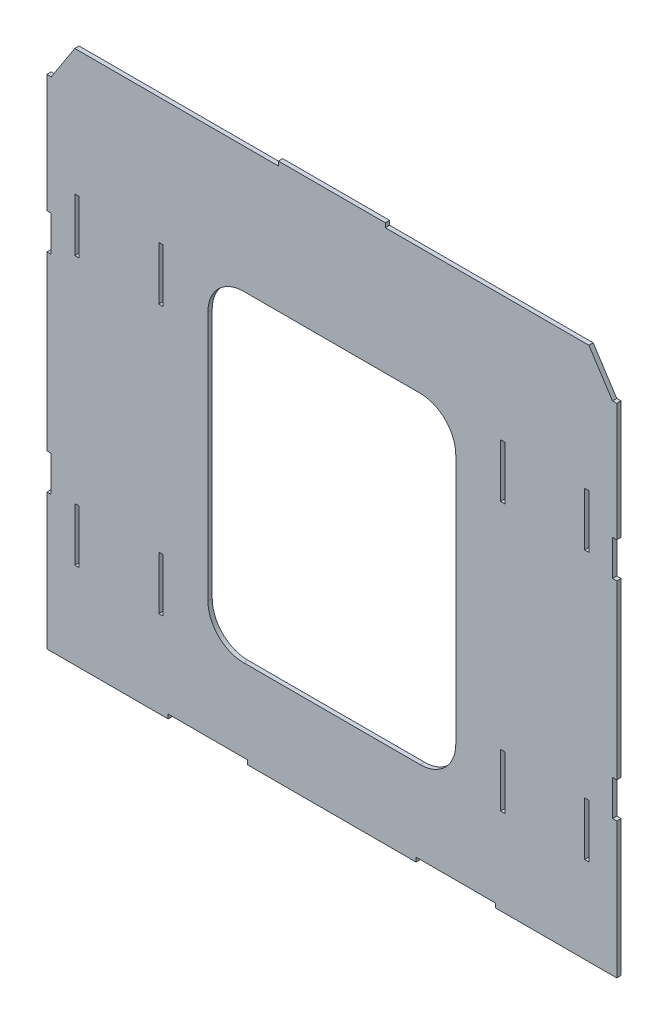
ISO-10303-21;
HEADER;
FILE_DESCRIPTION(('STEP AP214'),'2;1');
FILE_NAME('part.step','',(''),(''),'','','');
FILE_SCHEMA(('AUTOMOTIVE_DESIGN { 1 0 10303 214 1 1 1 1 }'));
ENDSEC;
DATA;
#1=APPLICATION_CONTEXT('core data for automotive mechanical design processes');
#2=APPLICATION_PROTOCOL_DEFINITION('international standard','automotive_design',2000,#1);
#3=PRODUCT_CONTEXT('',#1,'mechanical');
#4=PRODUCT('Part','Part','',(#3));
#5=PRODUCT_RELATED_PRODUCT_CATEGORY('part','',(#4));
#6=PRODUCT_DEFINITION_FORMATION('','',#4);
#7=PRODUCT_DEFINITION_CONTEXT('part definition',#1,'design');
#8=PRODUCT_DEFINITION('design','',#6,#7);
#9=PRODUCT_DEFINITION_SHAPE('','',#8);
#10=(LENGTH_UNIT() NAMED_UNIT(*) SI_UNIT(.MILLI.,.METRE.));
#11=(NAMED_UNIT(*) PLANE_ANGLE_UNIT() SI_UNIT($,.RADIAN.));
#12=(NAMED_UNIT(*) SI_UNIT($,.STERADIAN.) SOLID_ANGLE_UNIT());
#13=UNCERTAINTY_MEASURE_WITH_UNIT(LENGTH_MEASURE(1.E-05),#10,'distance_accuracy_value','');
#14=(GEOMETRIC_REPRESENTATION_CONTEXT(3) GLOBAL_UNCERTAINTY_ASSIGNED_CONTEXT((#13)) GLOBAL_UNIT_ASSIGNED_CONTEXT((#10,
#11,#12)) REPRESENTATION_CONTEXT('',''));
#15=CARTESIAN_POINT('',(0.,0.,0.));
#16=DIRECTION('',(0.,0.,1.));
#17=DIRECTION('',(1.,0.,0.));
#18=AXIS2_PLACEMENT_3D('',#15,#16,#17);
#19=CARTESIAN_POINT('',(125.476,0.,1.524));
#20=DIRECTION('',(1.,0.,0.));
#21=DIRECTION('',(0.,0.,-1.));
#22=AXIS2_PLACEMENT_3D('',#19,#20,#21);
#23=PLANE('',#22);
#24=DIRECTION('',(0.,-1.,0.));
#25=VECTOR('',#24,1.);
#26=CARTESIAN_POINT('',(125.476,0.,0.));
#27=LINE('',#26,#25);
#28=CARTESIAN_POINT('',(125.476,48.4688364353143,0.));
#29=VERTEX_POINT('',#28);
#30=CARTESIAN_POINT('',(125.476,0.,0.));
#31=VERTEX_POINT('',#30);
#32=EDGE_CURVE('E701',#29,#31,#27,.T.);
#33=ORIENTED_EDGE('',*,*,#32,.T.);
#34=DIRECTION('',(0.,0.,-1.));
#35=VECTOR('',#34,1.);
#36=CARTESIAN_POINT('',(125.476,0.,1.524));
#37=LINE('',#36,#35);
#38=CARTESIAN_POINT('',(125.476,0.,1.524));
#39=VERTEX_POINT('',#38);
#40=EDGE_CURVE('E966',#39,#31,#37,.T.);
#41=ORIENTED_EDGE('',*,*,#40,.F.);
#42=DIRECTION('',(0.,-1.,0.));
#43=VECTOR('',#42,1.);
#44=CARTESIAN_POINT('',(125.476,0.,1.524));
#45=LINE('',#44,#43);
#46=CARTESIAN_POINT('',(125.476,48.4688364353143,1.524));
#47=VERTEX_POINT('',#46);
#48=EDGE_CURVE('E716',#47,#39,#45,.T.);
#49=ORIENTED_EDGE('',*,*,#48,.F.);
#50=DIRECTION('',(0.,0.,-1.));
#51=VECTOR('',#50,1.);
#52=CARTESIAN_POINT('',(125.476,48.4688364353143,1.524));
#53=LINE('',#52,#51);
#54=EDGE_CURVE('E790',#47,#29,#53,.T.);
#55=ORIENTED_EDGE('',*,*,#54,.T.);
#56=EDGE_LOOP('',(#33,#41,#49,#55));
#57=FACE_BOUND('',#56,.T.);
#58=ADVANCED_FACE('F36',(#57),#23,.F.);
#59=CARTESIAN_POINT('',(125.476,0.,1.524));
#60=DIRECTION('',(0.,1.,0.));
#61=DIRECTION('',(-1.,0.,0.));
#62=AXIS2_PLACEMENT_3D('',#59,#60,#61);
#63=PLANE('',#62);
#64=DIRECTION('',(1.,0.,0.));
#65=VECTOR('',#64,1.);
#66=CARTESIAN_POINT('',(125.476,0.,0.));
#67=LINE('',#66,#65);
#68=CARTESIAN_POINT('',(168.711255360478,0.,0.));
#69=VERTEX_POINT('',#68);
#70=EDGE_CURVE('E793',#31,#69,#67,.T.);
#71=ORIENTED_EDGE('',*,*,#70,.T.);
#72=DIRECTION('',(0.,0.,-1.));
#73=VECTOR('',#72,1.);
#74=CARTESIAN_POINT('',(168.711255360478,0.,1.524));
#75=LINE('',#74,#73);
#76=CARTESIAN_POINT('',(168.711255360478,0.,1.524));
#77=VERTEX_POINT('',#76);
#78=EDGE_CURVE('E963',#77,#69,#75,.T.);
#79=ORIENTED_EDGE('',*,*,#78,.F.);
#80=DIRECTION('',(1.,0.,0.));
#81=VECTOR('',#80,1.);
#82=CARTESIAN_POINT('',(125.476,0.,1.524));
#83=LINE('',#82,#81);
#84=EDGE_CURVE('E719',#39,#77,#83,.T.);
#85=ORIENTED_EDGE('',*,*,#84,.F.);
#86=ORIENTED_EDGE('',*,*,#40,.T.);
#87=EDGE_LOOP('',(#71,#79,#85,#86));
#88=FACE_BOUND('',#87,.T.);
#89=ADVANCED_FACE('F1074',(#88),#63,.F.);
#90=CARTESIAN_POINT('',(168.711255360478,0.,1.524));
#91=DIRECTION('',(-1.,0.,0.));
#92=DIRECTION('',(0.,0.,1.));
#93=AXIS2_PLACEMENT_3D('',#90,#91,#92);
#94=PLANE('',#93);
#95=DIRECTION('',(0.,1.,0.));
#96=VECTOR('',#95,1.);
#97=CARTESIAN_POINT('',(168.711255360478,0.,0.));
#98=LINE('',#97,#96);
#99=CARTESIAN_POINT('',(168.711255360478,1.524,0.));
#100=VERTEX_POINT('',#99);
#101=EDGE_CURVE('E795',#69,#100,#98,.T.);
#102=ORIENTED_EDGE('',*,*,#101,.T.);
#103=DIRECTION('',(0.,0.,-1.));
#104=VECTOR('',#103,1.);
#105=CARTESIAN_POINT('',(168.711255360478,1.524,1.524));
#106=LINE('',#105,#104);
#107=CARTESIAN_POINT('',(168.711255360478,1.524,1.524));
#108=VERTEX_POINT('',#107);
#109=EDGE_CURVE('E960',#108,#100,#106,.T.);
#110=ORIENTED_EDGE('',*,*,#109,.F.);
#111=DIRECTION('',(0.,1.,0.));
#112=VECTOR('',#111,1.);
#113=CARTESIAN_POINT('',(168.711255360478,0.,1.524));
#114=LINE('',#113,#112);
#115=EDGE_CURVE('E722',#77,#108,#114,.T.);
#116=ORIENTED_EDGE('',*,*,#115,.F.);
#117=ORIENTED_EDGE('',*,*,#78,.T.);
#118=EDGE_LOOP('',(#102,#110,#116,#117));
#119=FACE_BOUND('',#118,.T.);
#120=ADVANCED_FACE('F1079',(#119),#94,.F.);
#121=CARTESIAN_POINT('',(168.711255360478,1.524,1.524));
#122=DIRECTION('',(0.,1.,0.));
#123=DIRECTION('',(0.,0.,1.));
#124=AXIS2_PLACEMENT_3D('',#121,#122,#123);
#125=PLANE('',#124);
#126=DIRECTION('',(1.,0.,0.));
#127=VECTOR('',#126,1.);
#128=CARTESIAN_POINT('',(168.711255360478,1.524,0.));
#129=LINE('',#128,#127);
#130=CARTESIAN_POINT('',(197.062900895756,1.524,0.));
#131=VERTEX_POINT('',#130);
#132=EDGE_CURVE('E797',#100,#131,#129,.T.);
#133=ORIENTED_EDGE('',*,*,#132,.T.);
#134=DIRECTION('',(0.,0.,-1.));
#135=VECTOR('',#134,1.);
#136=CARTESIAN_POINT('',(197.062900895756,1.524,1.524));
#137=LINE('',#136,#135);
#138=CARTESIAN_POINT('',(197.062900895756,1.524,1.524));
#139=VERTEX_POINT('',#138);
#140=EDGE_CURVE('E957',#139,#131,#137,.T.);
#141=ORIENTED_EDGE('',*,*,#140,.F.);
#142=DIRECTION('',(1.,0.,0.));
#143=VECTOR('',#142,1.);
#144=CARTESIAN_POINT('',(168.711255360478,1.524,1.524));
#145=LINE('',#144,#143);
#146=EDGE_CURVE('E724',#108,#139,#145,.T.);
#147=ORIENTED_EDGE('',*,*,#146,.F.);
#148=ORIENTED_EDGE('',*,*,#109,.T.);
#149=EDGE_LOOP('',(#133,#141,#147,#148));
#150=FACE_BOUND('',#149,.T.);
#151=ADVANCED_FACE('F1252',(#150),#125,.F.);
#152=CARTESIAN_POINT('',(197.062900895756,1.524,1.524));
#153=DIRECTION('',(1.,0.,0.));
#154=DIRECTION('',(0.,0.,-1.));
#155=AXIS2_PLACEMENT_3D('',#152,#153,#154);
#156=PLANE('',#155);
#157=DIRECTION('',(0.,-1.,0.));
#158=VECTOR('',#157,1.);
#159=CARTESIAN_POINT('',(197.062900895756,1.524,0.));
#160=LINE('',#159,#158);
#161=CARTESIAN_POINT('',(197.062900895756,0.,0.));
#162=VERTEX_POINT('',#161);
#163=EDGE_CURVE('E799',#131,#162,#160,.T.);
#164=ORIENTED_EDGE('',*,*,#163,.T.);
#165=DIRECTION('',(0.,0.,-1.));
#166=VECTOR('',#165,1.);
#167=CARTESIAN_POINT('',(197.062900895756,0.,1.524));
#168=LINE('',#167,#166);
#169=CARTESIAN_POINT('',(197.062900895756,0.,1.524));
#170=VERTEX_POINT('',#169);
#171=EDGE_CURVE('E954',#170,#162,#168,.T.);
#172=ORIENTED_EDGE('',*,*,#171,.F.);
#173=DIRECTION('',(0.,-1.,0.));
#174=VECTOR('',#173,1.);
#175=CARTESIAN_POINT('',(197.062900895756,1.524,1.524));
#176=LINE('',#175,#174);
#177=EDGE_CURVE('E726',#139,#170,#176,.T.);
#178=ORIENTED_EDGE('',*,*,#177,.F.);
#179=ORIENTED_EDGE('',*,*,#140,.T.);
#180=EDGE_LOOP('',(#164,#172,#178,#179));
#181=FACE_BOUND('',#180,.T.);
#182=ADVANCED_FACE('F1249',(#181),#156,.F.);
#183=CARTESIAN_POINT('',(197.062900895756,0.,1.524));
#184=DIRECTION('',(0.,1.,0.));
#185=DIRECTION('',(0.,0.,1.));
#186=AXIS2_PLACEMENT_3D('',#183,#184,#185);
#187=PLANE('',#186);
#188=DIRECTION('',(1.,0.,0.));
#189=VECTOR('',#188,1.);
#190=CARTESIAN_POINT('',(197.062900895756,0.,0.));
#191=LINE('',#190,#189);
#192=CARTESIAN_POINT('',(257.089099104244,0.,0.));
#193=VERTEX_POINT('',#192);
#194=EDGE_CURVE('E801',#162,#193,#191,.T.);
#195=ORIENTED_EDGE('',*,*,#194,.T.);
#196=DIRECTION('',(0.,0.,-1.));
#197=VECTOR('',#196,1.);
#198=CARTESIAN_POINT('',(257.089099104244,0.,1.524));
#199=LINE('',#198,#197);
#200=CARTESIAN_POINT('',(257.089099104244,0.,1.524));
#201=VERTEX_POINT('',#200);
#202=EDGE_CURVE('E951',#201,#193,#199,.T.);
#203=ORIENTED_EDGE('',*,*,#202,.F.);
#204=DIRECTION('',(1.,0.,0.));
#205=VECTOR('',#204,1.);
#206=CARTESIAN_POINT('',(197.062900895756,0.,1.524));
#207=LINE('',#206,#205);
#208=EDGE_CURVE('E728',#170,#201,#207,.T.);
#209=ORIENTED_EDGE('',*,*,#208,.F.);
#210=ORIENTED_EDGE('',*,*,#171,.T.);
#211=EDGE_LOOP('',(#195,#203,#209,#210));
#212=FACE_BOUND('',#211,.T.);
#213=ADVANCED_FACE('F1245',(#212),#187,.F.);
#214=CARTESIAN_POINT('',(257.089099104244,0.,1.524));
#215=DIRECTION('',(-1.,0.,0.));
#216=DIRECTION('',(0.,0.,1.));
#217=AXIS2_PLACEMENT_3D('',#214,#215,#216);
#218=PLANE('',#217);
#219=DIRECTION('',(0.,1.,0.));
#220=VECTOR('',#219,1.);
#221=CARTESIAN_POINT('',(257.089099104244,0.,0.));
#222=LINE('',#221,#220);
#223=CARTESIAN_POINT('',(257.089099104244,1.524,0.));
#224=VERTEX_POINT('',#223);
#225=EDGE_CURVE('E803',#193,#224,#222,.T.);
#226=ORIENTED_EDGE('',*,*,#225,.T.);
#227=DIRECTION('',(0.,0.,-1.));
#228=VECTOR('',#227,1.);
#229=CARTESIAN_POINT('',(257.089099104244,1.524,1.524));
#230=LINE('',#229,#228);
#231=CARTESIAN_POINT('',(257.089099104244,1.524,1.524));
#232=VERTEX_POINT('',#231);
#233=EDGE_CURVE('E948',#232,#224,#230,.T.);
#234=ORIENTED_EDGE('',*,*,#233,.F.);
#235=DIRECTION('',(0.,1.,0.));
#236=VECTOR('',#235,1.);
#237=CARTESIAN_POINT('',(257.089099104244,0.,1.524));
#238=LINE('',#237,#236);
#239=EDGE_CURVE('E730',#201,#232,#238,.T.);
#240=ORIENTED_EDGE('',*,*,#239,.F.);
#241=ORIENTED_EDGE('',*,*,#202,.T.);
#242=EDGE_LOOP('',(#226,#234,#240,#241));
#243=FACE_BOUND('',#242,.T.);
#244=ADVANCED_FACE('F1240',(#243),#218,.F.);
#245=CARTESIAN_POINT('',(257.089099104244,1.524,1.524));
#246=DIRECTION('',(0.,1.,0.));
#247=DIRECTION('',(0.,0.,1.));
#248=AXIS2_PLACEMENT_3D('',#245,#246,#247);
#249=PLANE('',#248);
#250=DIRECTION('',(1.,0.,0.));
#251=VECTOR('',#250,1.);
#252=CARTESIAN_POINT('',(257.089099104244,1.524,0.));
#253=LINE('',#252,#251);
#254=CARTESIAN_POINT('',(285.440744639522,1.524,0.));
#255=VERTEX_POINT('',#254);
#256=EDGE_CURVE('E805',#224,#255,#253,.T.);
#257=ORIENTED_EDGE('',*,*,#256,.T.);
#258=DIRECTION('',(0.,0.,-1.));
#259=VECTOR('',#258,1.);
#260=CARTESIAN_POINT('',(285.440744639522,1.524,1.524));
#261=LINE('',#260,#259);
#262=CARTESIAN_POINT('',(285.440744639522,1.524,1.524));
#263=VERTEX_POINT('',#262);
#264=EDGE_CURVE('E945',#263,#255,#261,.T.);
#265=ORIENTED_EDGE('',*,*,#264,.F.);
#266=DIRECTION('',(1.,0.,0.));
#267=VECTOR('',#266,1.);
#268=CARTESIAN_POINT('',(257.089099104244,1.524,1.524));
#269=LINE('',#268,#267);
#270=EDGE_CURVE('E732',#232,#263,#269,.T.);
#271=ORIENTED_EDGE('',*,*,#270,.F.);
#272=ORIENTED_EDGE('',*,*,#233,.T.);
#273=EDGE_LOOP('',(#257,#265,#271,#272));
#274=FACE_BOUND('',#273,.T.);
#275=ADVANCED_FACE('F1234',(#274),#249,.F.);
#276=CARTESIAN_POINT('',(285.440744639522,1.524,1.524));
#277=DIRECTION('',(1.,0.,0.));
#278=DIRECTION('',(0.,0.,-1.));
#279=AXIS2_PLACEMENT_3D('',#276,#277,#278);
#280=PLANE('',#279);
#281=DIRECTION('',(0.,-1.,0.));
#282=VECTOR('',#281,1.);
#283=CARTESIAN_POINT('',(285.440744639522,1.524,0.));
#284=LINE('',#283,#282);
#285=CARTESIAN_POINT('',(285.440744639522,0.,0.));
#286=VERTEX_POINT('',#285);
#287=EDGE_CURVE('E807',#255,#286,#284,.T.);
#288=ORIENTED_EDGE('',*,*,#287,.T.);
#289=DIRECTION('',(0.,0.,-1.));
#290=VECTOR('',#289,1.);
#291=CARTESIAN_POINT('',(285.440744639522,0.,1.524));
#292=LINE('',#291,#290);
#293=CARTESIAN_POINT('',(285.440744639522,0.,1.524));
#294=VERTEX_POINT('',#293);
#295=EDGE_CURVE('E942',#294,#286,#292,.T.);
#296=ORIENTED_EDGE('',*,*,#295,.F.);
#297=DIRECTION('',(0.,-1.,0.));
#298=VECTOR('',#297,1.);
#299=CARTESIAN_POINT('',(285.440744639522,1.524,1.524));
#300=LINE('',#299,#298);
#301=EDGE_CURVE('E734',#263,#294,#300,.T.);
#302=ORIENTED_EDGE('',*,*,#301,.F.);
#303=ORIENTED_EDGE('',*,*,#264,.T.);
#304=EDGE_LOOP('',(#288,#296,#302,#303));
#305=FACE_BOUND('',#304,.T.);
#306=ADVANCED_FACE('F1230',(#305),#280,.F.);
#307=CARTESIAN_POINT('',(285.440744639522,0.,1.524));
#308=DIRECTION('',(0.,1.,0.));
#309=DIRECTION('',(-1.,0.,0.));
#310=AXIS2_PLACEMENT_3D('',#307,#308,#309);
#311=PLANE('',#310);
#312=DIRECTION('',(1.,0.,0.));
#313=VECTOR('',#312,1.);
#314=CARTESIAN_POINT('',(285.440744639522,0.,0.));
#315=LINE('',#314,#313);
#316=CARTESIAN_POINT('',(328.676,0.,0.));
#317=VERTEX_POINT('',#316);
#318=EDGE_CURVE('E809',#286,#317,#315,.T.);
#319=ORIENTED_EDGE('',*,*,#318,.T.);
#320=DIRECTION('',(0.,0.,-1.));
#321=VECTOR('',#320,1.);
#322=CARTESIAN_POINT('',(328.676,0.,1.524));
#323=LINE('',#322,#321);
#324=CARTESIAN_POINT('',(328.676,0.,1.524));
#325=VERTEX_POINT('',#324);
#326=EDGE_CURVE('E939',#325,#317,#323,.T.);
#327=ORIENTED_EDGE('',*,*,#326,.F.);
#328=DIRECTION('',(1.,0.,0.));
#329=VECTOR('',#328,1.);
#330=CARTESIAN_POINT('',(285.440744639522,0.,1.524));
#331=LINE('',#330,#329);
#332=EDGE_CURVE('E736',#294,#325,#331,.T.);
#333=ORIENTED_EDGE('',*,*,#332,.F.);
#334=ORIENTED_EDGE('',*,*,#295,.T.);
#335=EDGE_LOOP('',(#319,#327,#333,#334));
#336=FACE_BOUND('',#335,.T.);
#337=ADVANCED_FACE('F1225',(#336),#311,.F.);
#338=CARTESIAN_POINT('',(328.676,0.,1.524));
#339=DIRECTION('',(-1.,0.,0.));
#340=DIRECTION('',(0.,0.,1.));
#341=AXIS2_PLACEMENT_3D('',#338,#339,#340);
#342=PLANE('',#341);
#343=DIRECTION('',(0.,1.,0.));
#344=VECTOR('',#343,1.);
#345=CARTESIAN_POINT('',(328.676,0.,0.));
#346=LINE('',#345,#344);
#347=CARTESIAN_POINT('',(328.676,48.4688364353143,0.));
#348=VERTEX_POINT('',#347);
#349=EDGE_CURVE('E811',#317,#348,#346,.T.);
#350=ORIENTED_EDGE('',*,*,#349,.T.);
#351=DIRECTION('',(0.,0.,-1.));
#352=VECTOR('',#351,1.);
#353=CARTESIAN_POINT('',(328.676,48.4688364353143,1.524));
#354=LINE('',#353,#352);
#355=CARTESIAN_POINT('',(328.676,48.4688364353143,1.524));
#356=VERTEX_POINT('',#355);
#357=EDGE_CURVE('E936',#356,#348,#354,.T.);
#358=ORIENTED_EDGE('',*,*,#357,.F.);
#359=DIRECTION('',(0.,1.,0.));
#360=VECTOR('',#359,1.);
#361=CARTESIAN_POINT('',(328.676,0.,1.524));
#362=LINE('',#361,#360);
#363=EDGE_CURVE('E738',#325,#356,#362,.T.);
#364=ORIENTED_EDGE('',*,*,#363,.F.);
#365=ORIENTED_EDGE('',*,*,#326,.T.);
#366=EDGE_LOOP('',(#350,#358,#364,#365));
#367=FACE_BOUND('',#366,.T.);
#368=ADVANCED_FACE('F1219',(#367),#342,.F.);
#369=CARTESIAN_POINT('',(328.676,48.4688364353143,1.524));
#370=DIRECTION('',(0.,-1.,0.));
#371=DIRECTION('',(0.,0.,-1.));
#372=AXIS2_PLACEMENT_3D('',#369,#370,#371);
#373=PLANE('',#372);
#374=DIRECTION('',(-1.,0.,0.));
#375=VECTOR('',#374,1.);
#376=CARTESIAN_POINT('',(328.676,48.4688364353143,0.));
#377=LINE('',#376,#375);
#378=CARTESIAN_POINT('',(327.152,48.4688364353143,0.));
#379=VERTEX_POINT('',#378);
#380=EDGE_CURVE('E813',#348,#379,#377,.T.);
#381=ORIENTED_EDGE('',*,*,#380,.T.);
#382=DIRECTION('',(0.,0.,-1.));
#383=VECTOR('',#382,1.);
#384=CARTESIAN_POINT('',(327.152,48.4688364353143,1.524));
#385=LINE('',#384,#383);
#386=CARTESIAN_POINT('',(327.152,48.4688364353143,1.524));
#387=VERTEX_POINT('',#386);
#388=EDGE_CURVE('E933',#387,#379,#385,.T.);
#389=ORIENTED_EDGE('',*,*,#388,.F.);
#390=DIRECTION('',(-1.,0.,0.));
#391=VECTOR('',#390,1.);
#392=CARTESIAN_POINT('',(328.676,48.4688364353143,1.524));
#393=LINE('',#392,#391);
#394=EDGE_CURVE('E740',#356,#387,#393,.T.);
#395=ORIENTED_EDGE('',*,*,#394,.F.);
#396=ORIENTED_EDGE('',*,*,#357,.T.);
#397=EDGE_LOOP('',(#381,#389,#395,#396));
#398=FACE_BOUND('',#397,.T.);
#399=ADVANCED_FACE('F1215',(#398),#373,.F.);
#400=CARTESIAN_POINT('',(327.152,48.4688364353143,1.524));
#401=DIRECTION('',(-1.,0.,0.));
#402=DIRECTION('',(0.,0.,1.));
#403=AXIS2_PLACEMENT_3D('',#400,#401,#402);
#404=PLANE('',#403);
#405=DIRECTION('',(0.,1.,0.));
#406=VECTOR('',#405,1.);
#407=CARTESIAN_POINT('',(327.152,48.4688364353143,0.));
#408=LINE('',#407,#406);
#409=CARTESIAN_POINT('',(327.152,61.1688364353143,0.));
#410=VERTEX_POINT('',#409);
#411=EDGE_CURVE('E815',#379,#410,#408,.T.);
#412=ORIENTED_EDGE('',*,*,#411,.T.);
#413=DIRECTION('',(0.,0.,-1.));
#414=VECTOR('',#413,1.);
#415=CARTESIAN_POINT('',(327.152,61.1688364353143,1.524));
#416=LINE('',#415,#414);
#417=CARTESIAN_POINT('',(327.152,61.1688364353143,1.524));
#418=VERTEX_POINT('',#417);
#419=EDGE_CURVE('E930',#418,#410,#416,.T.);
#420=ORIENTED_EDGE('',*,*,#419,.F.);
#421=DIRECTION('',(0.,1.,0.));
#422=VECTOR('',#421,1.);
#423=CARTESIAN_POINT('',(327.152,48.4688364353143,1.524));
#424=LINE('',#423,#422);
#425=EDGE_CURVE('E742',#387,#418,#424,.T.);
#426=ORIENTED_EDGE('',*,*,#425,.F.);
#427=ORIENTED_EDGE('',*,*,#388,.T.);
#428=EDGE_LOOP('',(#412,#420,#426,#427));
#429=FACE_BOUND('',#428,.T.);
#430=ADVANCED_FACE('F1210',(#429),#404,.F.);
#431=CARTESIAN_POINT('',(328.676,61.1688364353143,1.524));
#432=DIRECTION('',(0.,1.,0.));
#433=DIRECTION('',(0.,0.,1.));
#434=AXIS2_PLACEMENT_3D('',#431,#432,#433);
#435=PLANE('',#434);
#436=DIRECTION('',(1.,0.,0.));
#437=VECTOR('',#436,1.);
#438=CARTESIAN_POINT('',(328.676,61.1688364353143,0.));
#439=LINE('',#438,#437);
#440=CARTESIAN_POINT('',(328.676,61.1688364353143,0.));
#441=VERTEX_POINT('',#440);
#442=EDGE_CURVE('E817',#410,#441,#439,.T.);
#443=ORIENTED_EDGE('',*,*,#442,.T.);
#444=DIRECTION('',(0.,0.,-1.));
#445=VECTOR('',#444,1.);
#446=CARTESIAN_POINT('',(328.676,61.1688364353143,1.524));
#447=LINE('',#446,#445);
#448=CARTESIAN_POINT('',(328.676,61.1688364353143,1.524));
#449=VERTEX_POINT('',#448);
#450=EDGE_CURVE('E927',#449,#441,#447,.T.);
#451=ORIENTED_EDGE('',*,*,#450,.F.);
#452=DIRECTION('',(1.,0.,0.));
#453=VECTOR('',#452,1.);
#454=CARTESIAN_POINT('',(328.676,61.1688364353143,1.524));
#455=LINE('',#454,#453);
#456=EDGE_CURVE('E744',#418,#449,#455,.T.);
#457=ORIENTED_EDGE('',*,*,#456,.F.);
#458=ORIENTED_EDGE('',*,*,#419,.T.);
#459=EDGE_LOOP('',(#443,#451,#457,#458));
#460=FACE_BOUND('',#459,.T.);
#461=ADVANCED_FACE('F1204',(#460),#435,.F.);
#462=CARTESIAN_POINT('',(328.676,61.1688364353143,1.524));
#463=DIRECTION('',(-1.,0.,0.));
#464=DIRECTION('',(0.,0.,1.));
#465=AXIS2_PLACEMENT_3D('',#462,#463,#464);
#466=PLANE('',#465);
#467=DIRECTION('',(0.,1.,0.));
#468=VECTOR('',#467,1.);
#469=CARTESIAN_POINT('',(328.676,61.1688364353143,0.));
#470=LINE('',#469,#468);
#471=CARTESIAN_POINT('',(328.676,122.630588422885,0.));
#472=VERTEX_POINT('',#471);
#473=EDGE_CURVE('E819',#441,#472,#470,.T.);
#474=ORIENTED_EDGE('',*,*,#473,.T.);
#475=DIRECTION('',(0.,0.,-1.));
#476=VECTOR('',#475,1.);
#477=CARTESIAN_POINT('',(328.676,122.630588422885,1.524));
#478=LINE('',#477,#476);
#479=CARTESIAN_POINT('',(328.676,122.630588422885,1.524));
#480=VERTEX_POINT('',#479);
#481=EDGE_CURVE('E924',#480,#472,#478,.T.);
#482=ORIENTED_EDGE('',*,*,#481,.F.);
#483=DIRECTION('',(0.,1.,0.));
#484=VECTOR('',#483,1.);
#485=CARTESIAN_POINT('',(328.676,61.1688364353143,1.524));
#486=LINE('',#485,#484);
#487=EDGE_CURVE('E746',#449,#480,#486,.T.);
#488=ORIENTED_EDGE('',*,*,#487,.F.);
#489=ORIENTED_EDGE('',*,*,#450,.T.);
#490=EDGE_LOOP('',(#474,#482,#488,#489));
#491=FACE_BOUND('',#490,.T.);
#492=ADVANCED_FACE('F1200',(#491),#466,.F.);
#493=CARTESIAN_POINT('',(328.676,122.630588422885,1.524));
#494=DIRECTION('',(0.,-1.,0.));
#495=DIRECTION('',(0.,0.,-1.));
#496=AXIS2_PLACEMENT_3D('',#493,#494,#495);
#497=PLANE('',#496);
#498=DIRECTION('',(-1.,0.,0.));
#499=VECTOR('',#498,1.);
#500=CARTESIAN_POINT('',(328.676,122.630588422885,0.));
#501=LINE('',#500,#499);
#502=CARTESIAN_POINT('',(327.152,122.630588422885,0.));
#503=VERTEX_POINT('',#502);
#504=EDGE_CURVE('E821',#472,#503,#501,.T.);
#505=ORIENTED_EDGE('',*,*,#504,.T.);
#506=DIRECTION('',(0.,0.,-1.));
#507=VECTOR('',#506,1.);
#508=CARTESIAN_POINT('',(327.152,122.630588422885,1.524));
#509=LINE('',#508,#507);
#510=CARTESIAN_POINT('',(327.152,122.630588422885,1.524));
#511=VERTEX_POINT('',#510);
#512=EDGE_CURVE('E921',#511,#503,#509,.T.);
#513=ORIENTED_EDGE('',*,*,#512,.F.);
#514=DIRECTION('',(-1.,0.,0.));
#515=VECTOR('',#514,1.);
#516=CARTESIAN_POINT('',(328.676,122.630588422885,1.524));
#517=LINE('',#516,#515);
#518=EDGE_CURVE('E748',#480,#511,#517,.T.);
#519=ORIENTED_EDGE('',*,*,#518,.F.);
#520=ORIENTED_EDGE('',*,*,#481,.T.);
#521=EDGE_LOOP('',(#505,#513,#519,#520));
#522=FACE_BOUND('',#521,.T.);
#523=ADVANCED_FACE('F1195',(#522),#497,.F.);
#524=CARTESIAN_POINT('',(327.152,135.330588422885,1.524));
#525=DIRECTION('',(-1.,0.,0.));
#526=DIRECTION('',(0.,0.,1.));
#527=AXIS2_PLACEMENT_3D('',#524,#525,#526);
#528=PLANE('',#527);
#529=DIRECTION('',(0.,1.,0.));
#530=VECTOR('',#529,1.);
#531=CARTESIAN_POINT('',(327.152,135.330588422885,0.));
#532=LINE('',#531,#530);
#533=CARTESIAN_POINT('',(327.152,135.330588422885,0.));
#534=VERTEX_POINT('',#533);
#535=EDGE_CURVE('E823',#503,#534,#532,.T.);
#536=ORIENTED_EDGE('',*,*,#535,.T.);
#537=DIRECTION('',(0.,0.,-1.));
#538=VECTOR('',#537,1.);
#539=CARTESIAN_POINT('',(327.152,135.330588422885,1.524));
#540=LINE('',#539,#538);
#541=CARTESIAN_POINT('',(327.152,135.330588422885,1.524));
#542=VERTEX_POINT('',#541);
#543=EDGE_CURVE('E918',#542,#534,#540,.T.);
#544=ORIENTED_EDGE('',*,*,#543,.F.);
#545=DIRECTION('',(0.,1.,0.));
#546=VECTOR('',#545,1.);
#547=CARTESIAN_POINT('',(327.152,135.330588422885,1.524));
#548=LINE('',#547,#546);
#549=EDGE_CURVE('E750',#511,#542,#548,.T.);
#550=ORIENTED_EDGE('',*,*,#549,.F.);
#551=ORIENTED_EDGE('',*,*,#512,.T.);
#552=EDGE_LOOP('',(#536,#544,#550,#551));
#553=FACE_BOUND('',#552,.T.);
#554=ADVANCED_FACE('F1189',(#553),#528,.F.);
#555=CARTESIAN_POINT('',(328.676,135.330588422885,1.524));
#556=DIRECTION('',(0.,1.,0.));
#557=DIRECTION('',(0.,0.,1.));
#558=AXIS2_PLACEMENT_3D('',#555,#556,#557);
#559=PLANE('',#558);
#560=DIRECTION('',(1.,0.,0.));
#561=VECTOR('',#560,1.);
#562=CARTESIAN_POINT('',(328.676,135.330588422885,0.));
#563=LINE('',#562,#561);
#564=CARTESIAN_POINT('',(328.676,135.330588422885,0.));
#565=VERTEX_POINT('',#564);
#566=EDGE_CURVE('E825',#534,#565,#563,.T.);
#567=ORIENTED_EDGE('',*,*,#566,.T.);
#568=DIRECTION('',(0.,0.,-1.));
#569=VECTOR('',#568,1.);
#570=CARTESIAN_POINT('',(328.676,135.330588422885,1.524));
#571=LINE('',#570,#569);
#572=CARTESIAN_POINT('',(328.676,135.330588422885,1.524));
#573=VERTEX_POINT('',#572);
#574=EDGE_CURVE('E915',#573,#565,#571,.T.);
#575=ORIENTED_EDGE('',*,*,#574,.F.);
#576=DIRECTION('',(1.,0.,0.));
#577=VECTOR('',#576,1.);
#578=CARTESIAN_POINT('',(328.676,135.330588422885,1.524));
#579=LINE('',#578,#577);
#580=EDGE_CURVE('E752',#542,#573,#579,.T.);
#581=ORIENTED_EDGE('',*,*,#580,.F.);
#582=ORIENTED_EDGE('',*,*,#543,.T.);
#583=EDGE_LOOP('',(#567,#575,#581,#582));
#584=FACE_BOUND('',#583,.T.);
#585=ADVANCED_FACE('F1185',(#584),#559,.F.);
#586=CARTESIAN_POINT('',(328.676,135.330588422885,1.524));
#587=DIRECTION('',(-1.,0.,0.));
#588=DIRECTION('',(0.,0.,1.));
#589=AXIS2_PLACEMENT_3D('',#586,#587,#588);
#590=PLANE('',#589);
#591=DIRECTION('',(0.,1.,0.));
#592=VECTOR('',#591,1.);
#593=CARTESIAN_POINT('',(328.676,135.330588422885,0.));
#594=LINE('',#593,#592);
#595=CARTESIAN_POINT('',(328.676,177.453164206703,0.));
#596=VERTEX_POINT('',#595);
#597=EDGE_CURVE('E827',#565,#596,#594,.T.);
#598=ORIENTED_EDGE('',*,*,#597,.T.);
#599=DIRECTION('',(0.,0.,-1.));
#600=VECTOR('',#599,1.);
#601=CARTESIAN_POINT('',(328.676,177.453164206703,1.524));
#602=LINE('',#601,#600);
#603=CARTESIAN_POINT('',(328.676,177.453164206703,1.524));
#604=VERTEX_POINT('',#603);
#605=EDGE_CURVE('E912',#604,#596,#602,.T.);
#606=ORIENTED_EDGE('',*,*,#605,.F.);
#607=DIRECTION('',(0.,1.,0.));
#608=VECTOR('',#607,1.);
#609=CARTESIAN_POINT('',(328.676,135.330588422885,1.524));
#610=LINE('',#609,#608);
#611=EDGE_CURVE('E754',#573,#604,#610,.T.);
#612=ORIENTED_EDGE('',*,*,#611,.F.);
#613=ORIENTED_EDGE('',*,*,#574,.T.);
#614=EDGE_LOOP('',(#598,#606,#612,#613));
#615=FACE_BOUND('',#614,.T.);
#616=ADVANCED_FACE('F1180',(#615),#590,.F.);
#617=CARTESIAN_POINT('',(328.676,177.453164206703,1.524));
#618=DIRECTION('',(0.,-1.,0.));
#619=DIRECTION('',(0.,0.,-1.));
#620=AXIS2_PLACEMENT_3D('',#617,#618,#619);
#621=PLANE('',#620);
#622=DIRECTION('',(-1.,0.,0.));
#623=VECTOR('',#622,1.);
#624=CARTESIAN_POINT('',(328.676,177.453164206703,0.));
#625=LINE('',#624,#623);
#626=CARTESIAN_POINT('',(327.152,177.453164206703,0.));
#627=VERTEX_POINT('',#626);
#628=EDGE_CURVE('E829',#596,#627,#625,.T.);
#629=ORIENTED_EDGE('',*,*,#628,.T.);
#630=DIRECTION('',(0.,0.,-1.));
#631=VECTOR('',#630,1.);
#632=CARTESIAN_POINT('',(327.152,177.453164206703,1.524));
#633=LINE('',#632,#631);
#634=CARTESIAN_POINT('',(327.152,177.453164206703,1.524));
#635=VERTEX_POINT('',#634);
#636=EDGE_CURVE('E909',#635,#627,#633,.T.);
#637=ORIENTED_EDGE('',*,*,#636,.F.);
#638=DIRECTION('',(-1.,0.,0.));
#639=VECTOR('',#638,1.);
#640=CARTESIAN_POINT('',(328.676,177.453164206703,1.524));
#641=LINE('',#640,#639);
#642=EDGE_CURVE('E756',#604,#635,#641,.T.);
#643=ORIENTED_EDGE('',*,*,#642,.F.);
#644=ORIENTED_EDGE('',*,*,#605,.T.);
#645=EDGE_LOOP('',(#629,#637,#643,#644));
#646=FACE_BOUND('',#645,.T.);
#647=ADVANCED_FACE('F1174',(#646),#621,.F.);
#648=CARTESIAN_POINT('',(318.720585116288,190.42807538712,1.524));
#649=DIRECTION('',(-0.83851086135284,-0.544884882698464,0.));
#650=DIRECTION('',(0.544884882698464,-0.83851086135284,0.));
#651=AXIS2_PLACEMENT_3D('',#648,#649,#650);
#652=PLANE('',#651);
#653=DIRECTION('',(-0.544884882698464,0.83851086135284,0.));
#654=VECTOR('',#653,1.);
#655=CARTESIAN_POINT('',(318.720585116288,190.42807538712,0.));
#656=LINE('',#655,#654);
#657=CARTESIAN_POINT('',(318.720585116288,190.42807538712,0.));
#658=VERTEX_POINT('',#657);
#659=EDGE_CURVE('E831',#627,#658,#656,.T.);
#660=ORIENTED_EDGE('',*,*,#659,.T.);
#661=DIRECTION('',(0.,0.,-1.));
#662=VECTOR('',#661,1.);
#663=CARTESIAN_POINT('',(318.720585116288,190.42807538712,1.524));
#664=LINE('',#663,#662);
#665=CARTESIAN_POINT('',(318.720585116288,190.42807538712,1.524));
#666=VERTEX_POINT('',#665);
#667=EDGE_CURVE('E906',#666,#658,#664,.T.);
#668=ORIENTED_EDGE('',*,*,#667,.F.);
#669=DIRECTION('',(-0.544884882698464,0.83851086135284,0.));
#670=VECTOR('',#669,1.);
#671=CARTESIAN_POINT('',(318.720585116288,190.42807538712,1.524));
#672=LINE('',#671,#670);
#673=EDGE_CURVE('E758',#635,#666,#672,.T.);
#674=ORIENTED_EDGE('',*,*,#673,.F.);
#675=ORIENTED_EDGE('',*,*,#636,.T.);
#676=EDGE_LOOP('',(#660,#668,#674,#675));
#677=FACE_BOUND('',#676,.T.);
#678=ADVANCED_FACE('F1170',(#677),#652,.F.);
#679=CARTESIAN_POINT('',(246.126,190.42807538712,1.524));
#680=DIRECTION('',(0.,-1.,0.));
#681=DIRECTION('',(0.,0.,-1.));
#682=AXIS2_PLACEMENT_3D('',#679,#680,#681);
#683=PLANE('',#682);
#684=DIRECTION('',(-1.,0.,0.));
#685=VECTOR('',#684,1.);
#686=CARTESIAN_POINT('',(246.126,190.42807538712,0.));
#687=LINE('',#686,#685);
#688=CARTESIAN_POINT('',(246.126,190.42807538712,0.));
#689=VERTEX_POINT('',#688);
#690=EDGE_CURVE('E833',#658,#689,#687,.T.);
#691=ORIENTED_EDGE('',*,*,#690,.T.);
#692=DIRECTION('',(0.,0.,-1.));
#693=VECTOR('',#692,1.);
#694=CARTESIAN_POINT('',(246.126,190.42807538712,1.524));
#695=LINE('',#694,#693);
#696=CARTESIAN_POINT('',(246.126,190.42807538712,1.524));
#697=VERTEX_POINT('',#696);
#698=EDGE_CURVE('E903',#697,#689,#695,.T.);
#699=ORIENTED_EDGE('',*,*,#698,.F.);
#700=DIRECTION('',(-1.,0.,0.));
#701=VECTOR('',#700,1.);
#702=CARTESIAN_POINT('',(246.126,190.42807538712,1.524));
#703=LINE('',#702,#701);
#704=EDGE_CURVE('E760',#666,#697,#703,.T.);
#705=ORIENTED_EDGE('',*,*,#704,.F.);
#706=ORIENTED_EDGE('',*,*,#667,.T.);
#707=EDGE_LOOP('',(#691,#699,#705,#706));
#708=FACE_BOUND('',#707,.T.);
#709=ADVANCED_FACE('F1165',(#708),#683,.F.);
#710=CARTESIAN_POINT('',(246.126,190.42807538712,1.524));
#711=DIRECTION('',(-1.,0.,0.));
#712=DIRECTION('',(0.,0.,1.));
#713=AXIS2_PLACEMENT_3D('',#710,#711,#712);
#714=PLANE('',#713);
#715=DIRECTION('',(0.,1.,0.));
#716=VECTOR('',#715,1.);
#717=CARTESIAN_POINT('',(246.126,190.42807538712,0.));
#718=LINE('',#717,#716);
#719=CARTESIAN_POINT('',(246.126,191.95207538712,0.));
#720=VERTEX_POINT('',#719);
#721=EDGE_CURVE('E835',#689,#720,#718,.T.);
#722=ORIENTED_EDGE('',*,*,#721,.T.);
#723=DIRECTION('',(0.,0.,-1.));
#724=VECTOR('',#723,1.);
#725=CARTESIAN_POINT('',(246.126,191.95207538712,1.524));
#726=LINE('',#725,#724);
#727=CARTESIAN_POINT('',(246.126,191.95207538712,1.524));
#728=VERTEX_POINT('',#727);
#729=EDGE_CURVE('E900',#728,#720,#726,.T.);
#730=ORIENTED_EDGE('',*,*,#729,.F.);
#731=DIRECTION('',(0.,1.,0.));
#732=VECTOR('',#731,1.);
#733=CARTESIAN_POINT('',(246.126,190.42807538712,1.524));
#734=LINE('',#733,#732);
#735=EDGE_CURVE('E762',#697,#728,#734,.T.);
#736=ORIENTED_EDGE('',*,*,#735,.F.);
#737=ORIENTED_EDGE('',*,*,#698,.T.);
#738=EDGE_LOOP('',(#722,#730,#736,#737));
#739=FACE_BOUND('',#738,.T.);
#740=ADVANCED_FACE('F1159',(#739),#714,.F.);
#741=CARTESIAN_POINT('',(208.026,191.95207538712,1.524));
#742=DIRECTION('',(0.,-1.,0.));
#743=DIRECTION('',(0.,0.,-1.));
#744=AXIS2_PLACEMENT_3D('',#741,#742,#743);
#745=PLANE('',#744);
#746=DIRECTION('',(-1.,0.,0.));
#747=VECTOR('',#746,1.);
#748=CARTESIAN_POINT('',(208.026,191.95207538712,0.));
#749=LINE('',#748,#747);
#750=CARTESIAN_POINT('',(208.026,191.95207538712,0.));
#751=VERTEX_POINT('',#750);
#752=EDGE_CURVE('E837',#720,#751,#749,.T.);
#753=ORIENTED_EDGE('',*,*,#752,.T.);
#754=DIRECTION('',(0.,0.,-1.));
#755=VECTOR('',#754,1.);
#756=CARTESIAN_POINT('',(208.026,191.95207538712,1.524));
#757=LINE('',#756,#755);
#758=CARTESIAN_POINT('',(208.026,191.95207538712,1.524));
#759=VERTEX_POINT('',#758);
#760=EDGE_CURVE('E897',#759,#751,#757,.T.);
#761=ORIENTED_EDGE('',*,*,#760,.F.);
#762=DIRECTION('',(-1.,0.,0.));
#763=VECTOR('',#762,1.);
#764=CARTESIAN_POINT('',(208.026,191.95207538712,1.524));
#765=LINE('',#764,#763);
#766=EDGE_CURVE('E764',#728,#759,#765,.T.);
#767=ORIENTED_EDGE('',*,*,#766,.F.);
#768=ORIENTED_EDGE('',*,*,#729,.T.);
#769=EDGE_LOOP('',(#753,#761,#767,#768));
#770=FACE_BOUND('',#769,.T.);
#771=ADVANCED_FACE('F1155',(#770),#745,.F.);
#772=CARTESIAN_POINT('',(208.026,190.42807538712,1.524));
#773=DIRECTION('',(1.,0.,0.));
#774=DIRECTION('',(0.,0.,-1.));
#775=AXIS2_PLACEMENT_3D('',#772,#773,#774);
#776=PLANE('',#775);
#777=DIRECTION('',(0.,-1.,0.));
#778=VECTOR('',#777,1.);
#779=CARTESIAN_POINT('',(208.026,190.42807538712,0.));
#780=LINE('',#779,#778);
#781=CARTESIAN_POINT('',(208.026,190.42807538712,0.));
#782=VERTEX_POINT('',#781);
#783=EDGE_CURVE('E839',#751,#782,#780,.T.);
#784=ORIENTED_EDGE('',*,*,#783,.T.);
#785=DIRECTION('',(0.,0.,-1.));
#786=VECTOR('',#785,1.);
#787=CARTESIAN_POINT('',(208.026,190.42807538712,1.524));
#788=LINE('',#787,#786);
#789=CARTESIAN_POINT('',(208.026,190.42807538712,1.524));
#790=VERTEX_POINT('',#789);
#791=EDGE_CURVE('E894',#790,#782,#788,.T.);
#792=ORIENTED_EDGE('',*,*,#791,.F.);
#793=DIRECTION('',(0.,-1.,0.));
#794=VECTOR('',#793,1.);
#795=CARTESIAN_POINT('',(208.026,190.42807538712,1.524));
#796=LINE('',#795,#794);
#797=EDGE_CURVE('E766',#759,#790,#796,.T.);
#798=ORIENTED_EDGE('',*,*,#797,.F.);
#799=ORIENTED_EDGE('',*,*,#760,.T.);
#800=EDGE_LOOP('',(#784,#792,#798,#799));
#801=FACE_BOUND('',#800,.T.);
#802=ADVANCED_FACE('F1150',(#801),#776,.F.);
#803=CARTESIAN_POINT('',(135.431414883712,190.42807538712,1.524));
#804=DIRECTION('',(0.,-1.,0.));
#805=DIRECTION('',(0.,0.,-1.));
#806=AXIS2_PLACEMENT_3D('',#803,#804,#805);
#807=PLANE('',#806);
#808=DIRECTION('',(-1.,0.,0.));
#809=VECTOR('',#808,1.);
#810=CARTESIAN_POINT('',(135.431414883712,190.42807538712,0.));
#811=LINE('',#810,#809);
#812=CARTESIAN_POINT('',(135.431414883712,190.42807538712,0.));
#813=VERTEX_POINT('',#812);
#814=EDGE_CURVE('E841',#782,#813,#811,.T.);
#815=ORIENTED_EDGE('',*,*,#814,.T.);
#816=DIRECTION('',(0.,0.,-1.));
#817=VECTOR('',#816,1.);
#818=CARTESIAN_POINT('',(135.431414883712,190.42807538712,1.524));
#819=LINE('',#818,#817);
#820=CARTESIAN_POINT('',(135.431414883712,190.42807538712,1.524));
#821=VERTEX_POINT('',#820);
#822=EDGE_CURVE('E891',#821,#813,#819,.T.);
#823=ORIENTED_EDGE('',*,*,#822,.F.);
#824=DIRECTION('',(-1.,0.,0.));
#825=VECTOR('',#824,1.);
#826=CARTESIAN_POINT('',(135.431414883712,190.42807538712,1.524));
#827=LINE('',#826,#825);
#828=EDGE_CURVE('E768',#790,#821,#827,.T.);
#829=ORIENTED_EDGE('',*,*,#828,.F.);
#830=ORIENTED_EDGE('',*,*,#791,.T.);
#831=EDGE_LOOP('',(#815,#823,#829,#830));
#832=FACE_BOUND('',#831,.T.);
#833=ADVANCED_FACE('F1144',(#832),#807,.F.);
#834=CARTESIAN_POINT('',(127.,177.453164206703,1.524));
#835=DIRECTION('',(0.838510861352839,-0.544884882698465,0.));
#836=DIRECTION('',(0.544884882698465,0.838510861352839,0.));
#837=AXIS2_PLACEMENT_3D('',#834,#835,#836);
#838=PLANE('',#837);
#839=DIRECTION('',(-0.544884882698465,-0.838510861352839,0.));
#840=VECTOR('',#839,1.);
#841=CARTESIAN_POINT('',(127.,177.453164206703,0.));
#842=LINE('',#841,#840);
#843=CARTESIAN_POINT('',(127.,177.453164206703,0.));
#844=VERTEX_POINT('',#843);
#845=EDGE_CURVE('E843',#813,#844,#842,.T.);
#846=ORIENTED_EDGE('',*,*,#845,.T.);
#847=DIRECTION('',(0.,0.,-1.));
#848=VECTOR('',#847,1.);
#849=CARTESIAN_POINT('',(127.,177.453164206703,1.524));
#850=LINE('',#849,#848);
#851=CARTESIAN_POINT('',(127.,177.453164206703,1.524));
#852=VERTEX_POINT('',#851);
#853=EDGE_CURVE('E888',#852,#844,#850,.T.);
#854=ORIENTED_EDGE('',*,*,#853,.F.);
#855=DIRECTION('',(-0.544884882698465,-0.838510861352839,0.));
#856=VECTOR('',#855,1.);
#857=CARTESIAN_POINT('',(127.,177.453164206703,1.524));
#858=LINE('',#857,#856);
#859=EDGE_CURVE('E770',#821,#852,#858,.T.);
#860=ORIENTED_EDGE('',*,*,#859,.F.);
#861=ORIENTED_EDGE('',*,*,#822,.T.);
#862=EDGE_LOOP('',(#846,#854,#860,#861));
#863=FACE_BOUND('',#862,.T.);
#864=ADVANCED_FACE('F1140',(#863),#838,.F.);
#865=CARTESIAN_POINT('',(125.476,177.453164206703,1.524));
#866=DIRECTION('',(0.,-1.,0.));
#867=DIRECTION('',(0.,0.,-1.));
#868=AXIS2_PLACEMENT_3D('',#865,#866,#867);
#869=PLANE('',#868);
#870=DIRECTION('',(-1.,0.,0.));
#871=VECTOR('',#870,1.);
#872=CARTESIAN_POINT('',(125.476,177.453164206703,0.));
#873=LINE('',#872,#871);
#874=CARTESIAN_POINT('',(125.476,177.453164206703,0.));
#875=VERTEX_POINT('',#874);
#876=EDGE_CURVE('E845',#844,#875,#873,.T.);
#877=ORIENTED_EDGE('',*,*,#876,.T.);
#878=DIRECTION('',(0.,0.,-1.));
#879=VECTOR('',#878,1.);
#880=CARTESIAN_POINT('',(125.476,177.453164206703,1.524));
#881=LINE('',#880,#879);
#882=CARTESIAN_POINT('',(125.476,177.453164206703,1.524));
#883=VERTEX_POINT('',#882);
#884=EDGE_CURVE('E885',#883,#875,#881,.T.);
#885=ORIENTED_EDGE('',*,*,#884,.F.);
#886=DIRECTION('',(-1.,0.,0.));
#887=VECTOR('',#886,1.);
#888=CARTESIAN_POINT('',(125.476,177.453164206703,1.524));
#889=LINE('',#888,#887);
#890=EDGE_CURVE('E772',#852,#883,#889,.T.);
#891=ORIENTED_EDGE('',*,*,#890,.F.);
#892=ORIENTED_EDGE('',*,*,#853,.T.);
#893=EDGE_LOOP('',(#877,#885,#891,#892));
#894=FACE_BOUND('',#893,.T.);
#895=ADVANCED_FACE('F1135',(#894),#869,.F.);
#896=CARTESIAN_POINT('',(125.476,135.330588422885,1.524));
#897=DIRECTION('',(1.,0.,0.));
#898=DIRECTION('',(0.,0.,-1.));
#899=AXIS2_PLACEMENT_3D('',#896,#897,#898);
#900=PLANE('',#899);
#901=DIRECTION('',(0.,-1.,0.));
#902=VECTOR('',#901,1.);
#903=CARTESIAN_POINT('',(125.476,135.330588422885,0.));
#904=LINE('',#903,#902);
#905=CARTESIAN_POINT('',(125.476,135.330588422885,0.));
#906=VERTEX_POINT('',#905);
#907=EDGE_CURVE('E847',#875,#906,#904,.T.);
#908=ORIENTED_EDGE('',*,*,#907,.T.);
#909=DIRECTION('',(0.,0.,-1.));
#910=VECTOR('',#909,1.);
#911=CARTESIAN_POINT('',(125.476,135.330588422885,1.524));
#912=LINE('',#911,#910);
#913=CARTESIAN_POINT('',(125.476,135.330588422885,1.524));
#914=VERTEX_POINT('',#913);
#915=EDGE_CURVE('E882',#914,#906,#912,.T.);
#916=ORIENTED_EDGE('',*,*,#915,.F.);
#917=DIRECTION('',(0.,-1.,0.));
#918=VECTOR('',#917,1.);
#919=CARTESIAN_POINT('',(125.476,135.330588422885,1.524));
#920=LINE('',#919,#918);
#921=EDGE_CURVE('E774',#883,#914,#920,.T.);
#922=ORIENTED_EDGE('',*,*,#921,.F.);
#923=ORIENTED_EDGE('',*,*,#884,.T.);
#924=EDGE_LOOP('',(#908,#916,#922,#923));
#925=FACE_BOUND('',#924,.T.);
#926=ADVANCED_FACE('F1129',(#925),#900,.F.);
#927=CARTESIAN_POINT('',(125.476,135.330588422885,1.524));
#928=DIRECTION('',(0.,1.,0.));
#929=DIRECTION('',(0.,0.,1.));
#930=AXIS2_PLACEMENT_3D('',#927,#928,#929);
#931=PLANE('',#930);
#932=DIRECTION('',(1.,0.,0.));
#933=VECTOR('',#932,1.);
#934=CARTESIAN_POINT('',(125.476,135.330588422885,0.));
#935=LINE('',#934,#933);
#936=CARTESIAN_POINT('',(127.,135.330588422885,0.));
#937=VERTEX_POINT('',#936);
#938=EDGE_CURVE('E849',#906,#937,#935,.T.);
#939=ORIENTED_EDGE('',*,*,#938,.T.);
#940=DIRECTION('',(0.,0.,-1.));
#941=VECTOR('',#940,1.);
#942=CARTESIAN_POINT('',(127.,135.330588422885,1.524));
#943=LINE('',#942,#941);
#944=CARTESIAN_POINT('',(127.,135.330588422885,1.524));
#945=VERTEX_POINT('',#944);
#946=EDGE_CURVE('E879',#945,#937,#943,.T.);
#947=ORIENTED_EDGE('',*,*,#946,.F.);
#948=DIRECTION('',(1.,0.,0.));
#949=VECTOR('',#948,1.);
#950=CARTESIAN_POINT('',(125.476,135.330588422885,1.524));
#951=LINE('',#950,#949);
#952=EDGE_CURVE('E776',#914,#945,#951,.T.);
#953=ORIENTED_EDGE('',*,*,#952,.F.);
#954=ORIENTED_EDGE('',*,*,#915,.T.);
#955=EDGE_LOOP('',(#939,#947,#953,#954));
#956=FACE_BOUND('',#955,.T.);
#957=ADVANCED_FACE('F1125',(#956),#931,.F.);
#958=CARTESIAN_POINT('',(127.,135.330588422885,1.524));
#959=DIRECTION('',(1.,0.,0.));
#960=DIRECTION('',(0.,0.,-1.));
#961=AXIS2_PLACEMENT_3D('',#958,#959,#960);
#962=PLANE('',#961);
#963=DIRECTION('',(0.,-1.,0.));
#964=VECTOR('',#963,1.);
#965=CARTESIAN_POINT('',(127.,135.330588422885,0.));
#966=LINE('',#965,#964);
#967=CARTESIAN_POINT('',(127.,122.630588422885,0.));
#968=VERTEX_POINT('',#967);
#969=EDGE_CURVE('E851',#937,#968,#966,.T.);
#970=ORIENTED_EDGE('',*,*,#969,.T.);
#971=DIRECTION('',(0.,0.,-1.));
#972=VECTOR('',#971,1.);
#973=CARTESIAN_POINT('',(127.,122.630588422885,1.524));
#974=LINE('',#973,#972);
#975=CARTESIAN_POINT('',(127.,122.630588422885,1.524));
#976=VERTEX_POINT('',#975);
#977=EDGE_CURVE('E876',#976,#968,#974,.T.);
#978=ORIENTED_EDGE('',*,*,#977,.F.);
#979=DIRECTION('',(0.,-1.,0.));
#980=VECTOR('',#979,1.);
#981=CARTESIAN_POINT('',(127.,135.330588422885,1.524));
#982=LINE('',#981,#980);
#983=EDGE_CURVE('E778',#945,#976,#982,.T.);
#984=ORIENTED_EDGE('',*,*,#983,.F.);
#985=ORIENTED_EDGE('',*,*,#946,.T.);
#986=EDGE_LOOP('',(#970,#978,#984,#985));
#987=FACE_BOUND('',#986,.T.);
#988=ADVANCED_FACE('F1120',(#987),#962,.F.);
#989=CARTESIAN_POINT('',(125.476,122.630588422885,1.524));
#990=DIRECTION('',(0.,-1.,0.));
#991=DIRECTION('',(0.,0.,-1.));
#992=AXIS2_PLACEMENT_3D('',#989,#990,#991);
#993=PLANE('',#992);
#994=DIRECTION('',(-1.,0.,0.));
#995=VECTOR('',#994,1.);
#996=CARTESIAN_POINT('',(125.476,122.630588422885,0.));
#997=LINE('',#996,#995);
#998=CARTESIAN_POINT('',(125.476,122.630588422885,0.));
#999=VERTEX_POINT('',#998);
#1000=EDGE_CURVE('E853',#968,#999,#997,.T.);
#1001=ORIENTED_EDGE('',*,*,#1000,.T.);
#1002=DIRECTION('',(0.,0.,-1.));
#1003=VECTOR('',#1002,1.);
#1004=CARTESIAN_POINT('',(125.476,122.630588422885,1.524));
#1005=LINE('',#1004,#1003);
#1006=CARTESIAN_POINT('',(125.476,122.630588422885,1.524));
#1007=VERTEX_POINT('',#1006);
#1008=EDGE_CURVE('E873',#1007,#999,#1005,.T.);
#1009=ORIENTED_EDGE('',*,*,#1008,.F.);
#1010=DIRECTION('',(-1.,0.,0.));
#1011=VECTOR('',#1010,1.);
#1012=CARTESIAN_POINT('',(125.476,122.630588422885,1.524));
#1013=LINE('',#1012,#1011);
#1014=EDGE_CURVE('E780',#976,#1007,#1013,.T.);
#1015=ORIENTED_EDGE('',*,*,#1014,.F.);
#1016=ORIENTED_EDGE('',*,*,#977,.T.);
#1017=EDGE_LOOP('',(#1001,#1009,#1015,#1016));
#1018=FACE_BOUND('',#1017,.T.);
#1019=ADVANCED_FACE('F1114',(#1018),#993,.F.);
#1020=CARTESIAN_POINT('',(125.476,61.1688364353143,1.524));
#1021=DIRECTION('',(1.,0.,0.));
#1022=DIRECTION('',(0.,0.,-1.));
#1023=AXIS2_PLACEMENT_3D('',#1020,#1021,#1022);
#1024=PLANE('',#1023);
#1025=DIRECTION('',(0.,-1.,0.));
#1026=VECTOR('',#1025,1.);
#1027=CARTESIAN_POINT('',(125.476,61.1688364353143,0.));
#1028=LINE('',#1027,#1026);
#1029=CARTESIAN_POINT('',(125.476,61.1688364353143,0.));
#1030=VERTEX_POINT('',#1029);
#1031=EDGE_CURVE('E855',#999,#1030,#1028,.T.);
#1032=ORIENTED_EDGE('',*,*,#1031,.T.);
#1033=DIRECTION('',(0.,0.,-1.));
#1034=VECTOR('',#1033,1.);
#1035=CARTESIAN_POINT('',(125.476,61.1688364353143,1.524));
#1036=LINE('',#1035,#1034);
#1037=CARTESIAN_POINT('',(125.476,61.1688364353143,1.524));
#1038=VERTEX_POINT('',#1037);
#1039=EDGE_CURVE('E870',#1038,#1030,#1036,.T.);
#1040=ORIENTED_EDGE('',*,*,#1039,.F.);
#1041=DIRECTION('',(0.,-1.,0.));
#1042=VECTOR('',#1041,1.);
#1043=CARTESIAN_POINT('',(125.476,61.1688364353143,1.524));
#1044=LINE('',#1043,#1042);
#1045=EDGE_CURVE('E782',#1007,#1038,#1044,.T.);
#1046=ORIENTED_EDGE('',*,*,#1045,.F.);
#1047=ORIENTED_EDGE('',*,*,#1008,.T.);
#1048=EDGE_LOOP('',(#1032,#1040,#1046,#1047));
#1049=FACE_BOUND('',#1048,.T.);
#1050=ADVANCED_FACE('F1110',(#1049),#1024,.F.);
#1051=CARTESIAN_POINT('',(125.476,61.1688364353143,1.524));
#1052=DIRECTION('',(0.,1.,0.));
#1053=DIRECTION('',(0.,0.,1.));
#1054=AXIS2_PLACEMENT_3D('',#1051,#1052,#1053);
#1055=PLANE('',#1054);
#1056=DIRECTION('',(1.,0.,0.));
#1057=VECTOR('',#1056,1.);
#1058=CARTESIAN_POINT('',(125.476,61.1688364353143,0.));
#1059=LINE('',#1058,#1057);
#1060=CARTESIAN_POINT('',(127.,61.1688364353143,0.));
#1061=VERTEX_POINT('',#1060);
#1062=EDGE_CURVE('E857',#1030,#1061,#1059,.T.);
#1063=ORIENTED_EDGE('',*,*,#1062,.T.);
#1064=DIRECTION('',(0.,0.,-1.));
#1065=VECTOR('',#1064,1.);
#1066=CARTESIAN_POINT('',(127.,61.1688364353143,1.524));
#1067=LINE('',#1066,#1065);
#1068=CARTESIAN_POINT('',(127.,61.1688364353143,1.524));
#1069=VERTEX_POINT('',#1068);
#1070=EDGE_CURVE('E867',#1069,#1061,#1067,.T.);
#1071=ORIENTED_EDGE('',*,*,#1070,.F.);
#1072=DIRECTION('',(1.,0.,0.));
#1073=VECTOR('',#1072,1.);
#1074=CARTESIAN_POINT('',(125.476,61.1688364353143,1.524));
#1075=LINE('',#1074,#1073);
#1076=EDGE_CURVE('E784',#1038,#1069,#1075,.T.);
#1077=ORIENTED_EDGE('',*,*,#1076,.F.);
#1078=ORIENTED_EDGE('',*,*,#1039,.T.);
#1079=EDGE_LOOP('',(#1063,#1071,#1077,#1078));
#1080=FACE_BOUND('',#1079,.T.);
#1081=ADVANCED_FACE('F1105',(#1080),#1055,.F.);
#1082=CARTESIAN_POINT('',(127.,48.4688364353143,1.524));
#1083=DIRECTION('',(1.,0.,0.));
#1084=DIRECTION('',(0.,0.,-1.));
#1085=AXIS2_PLACEMENT_3D('',#1082,#1083,#1084);
#1086=PLANE('',#1085);
#1087=DIRECTION('',(0.,-1.,0.));
#1088=VECTOR('',#1087,1.);
#1089=CARTESIAN_POINT('',(127.,48.4688364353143,0.));
#1090=LINE('',#1089,#1088);
#1091=CARTESIAN_POINT('',(127.,48.4688364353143,0.));
#1092=VERTEX_POINT('',#1091);
#1093=EDGE_CURVE('E859',#1061,#1092,#1090,.T.);
#1094=ORIENTED_EDGE('',*,*,#1093,.T.);
#1095=DIRECTION('',(0.,0.,-1.));
#1096=VECTOR('',#1095,1.);
#1097=CARTESIAN_POINT('',(127.,48.4688364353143,1.524));
#1098=LINE('',#1097,#1096);
#1099=CARTESIAN_POINT('',(127.,48.4688364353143,1.524));
#1100=VERTEX_POINT('',#1099);
#1101=EDGE_CURVE('E864',#1100,#1092,#1098,.T.);
#1102=ORIENTED_EDGE('',*,*,#1101,.F.);
#1103=DIRECTION('',(0.,-1.,0.));
#1104=VECTOR('',#1103,1.);
#1105=CARTESIAN_POINT('',(127.,48.4688364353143,1.524));
#1106=LINE('',#1105,#1104);
#1107=EDGE_CURVE('E786',#1069,#1100,#1106,.T.);
#1108=ORIENTED_EDGE('',*,*,#1107,.F.);
#1109=ORIENTED_EDGE('',*,*,#1070,.T.);
#1110=EDGE_LOOP('',(#1094,#1102,#1108,#1109));
#1111=FACE_BOUND('',#1110,.T.);
#1112=ADVANCED_FACE('F1099',(#1111),#1086,.F.);
#1113=CARTESIAN_POINT('',(125.476,48.4688364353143,1.524));
#1114=DIRECTION('',(0.,-1.,0.));
#1115=DIRECTION('',(0.,0.,-1.));
#1116=AXIS2_PLACEMENT_3D('',#1113,#1114,#1115);
#1117=PLANE('',#1116);
#1118=DIRECTION('',(-1.,0.,0.));
#1119=VECTOR('',#1118,1.);
#1120=CARTESIAN_POINT('',(125.476,48.4688364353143,0.));
#1121=LINE('',#1120,#1119);
#1122=EDGE_CURVE('E720',#1092,#29,#1121,.T.);
#1123=ORIENTED_EDGE('',*,*,#1122,.T.);
#1124=ORIENTED_EDGE('',*,*,#54,.F.);
#1125=DIRECTION('',(-1.,0.,0.));
#1126=VECTOR('',#1125,1.);
#1127=CARTESIAN_POINT('',(125.476,48.4688364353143,1.524));
#1128=LINE('',#1127,#1126);
#1129=EDGE_CURVE('E788',#1100,#47,#1128,.T.);
#1130=ORIENTED_EDGE('',*,*,#1129,.F.);
#1131=ORIENTED_EDGE('',*,*,#1101,.T.);
#1132=EDGE_LOOP('',(#1123,#1124,#1130,#1131));
#1133=FACE_BOUND('',#1132,.T.);
#1134=ADVANCED_FACE('F1097',(#1133),#1117,.F.);
#1135=CARTESIAN_POINT('',(0.,0.,1.524));
#1136=DIRECTION('',(0.,0.,-1.));
#1137=DIRECTION('',(-1.,0.,0.));
#1138=AXIS2_PLACEMENT_3D('',#1135,#1136,#1137);
#1139=PLANE('',#1138);
#1140=DIRECTION('',(1.,0.,0.));
#1141=VECTOR('',#1140,1.);
#1142=CARTESIAN_POINT('',(135.431414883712,126.463267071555,1.524));
#1143=LINE('',#1142,#1141);
#1144=CARTESIAN_POINT('',(135.431414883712,126.463267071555,1.524));
#1145=VERTEX_POINT('',#1144);
#1146=CARTESIAN_POINT('',(136.955414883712,126.463267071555,1.524));
#1147=VERTEX_POINT('',#1146);
#1148=EDGE_CURVE('E519',#1145,#1147,#1143,.T.);
#1149=ORIENTED_EDGE('',*,*,#1148,.F.);
#1150=DIRECTION('',(0.,-1.,0.));
#1151=VECTOR('',#1150,1.);
#1152=CARTESIAN_POINT('',(135.431414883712,145.513267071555,1.524));
#1153=LINE('',#1152,#1151);
#1154=CARTESIAN_POINT('',(135.431414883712,145.513267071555,1.524));
#1155=VERTEX_POINT('',#1154);
#1156=EDGE_CURVE('E50',#1155,#1145,#1153,.T.);
#1157=ORIENTED_EDGE('',*,*,#1156,.F.);
#1158=DIRECTION('',(-1.,0.,0.));
#1159=VECTOR('',#1158,1.);
#1160=CARTESIAN_POINT('',(135.431414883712,145.513267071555,1.524));
#1161=LINE('',#1160,#1159);
#1162=CARTESIAN_POINT('',(136.955414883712,145.513267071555,1.524));
#1163=VERTEX_POINT('',#1162);
#1164=EDGE_CURVE('E526',#1163,#1155,#1161,.T.);
#1165=ORIENTED_EDGE('',*,*,#1164,.F.);
#1166=DIRECTION('',(0.,1.,0.));
#1167=VECTOR('',#1166,1.);
#1168=CARTESIAN_POINT('',(136.955414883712,145.513267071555,1.524));
#1169=LINE('',#1168,#1167);
#1170=EDGE_CURVE('E510',#1147,#1163,#1169,.T.);
#1171=ORIENTED_EDGE('',*,*,#1170,.F.);
#1172=EDGE_LOOP('',(#1149,#1157,#1165,#1171));
#1173=FACE_BOUND('',#1172,.T.);
#1174=DIRECTION('',(1.,0.,0.));
#1175=VECTOR('',#1174,1.);
#1176=CARTESIAN_POINT('',(135.431414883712,30.8386863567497,1.524));
#1177=LINE('',#1176,#1175);
#1178=CARTESIAN_POINT('',(135.431414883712,30.8386863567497,1.524));
#1179=VERTEX_POINT('',#1178);
#1180=CARTESIAN_POINT('',(136.955414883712,30.8386863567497,1.524));
#1181=VERTEX_POINT('',#1180);
#1182=EDGE_CURVE('E537',#1179,#1181,#1177,.T.);
#1183=ORIENTED_EDGE('',*,*,#1182,.F.);
#1184=DIRECTION('',(0.,-1.,0.));
#1185=VECTOR('',#1184,1.);
#1186=CARTESIAN_POINT('',(135.431414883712,30.8386863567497,1.524));
#1187=LINE('',#1186,#1185);
#1188=CARTESIAN_POINT('',(135.431414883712,49.8886863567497,1.524));
#1189=VERTEX_POINT('',#1188);
#1190=EDGE_CURVE('E533',#1189,#1179,#1187,.T.);
#1191=ORIENTED_EDGE('',*,*,#1190,.F.);
#1192=DIRECTION('',(-1.,0.,0.));
#1193=VECTOR('',#1192,1.);
#1194=CARTESIAN_POINT('',(135.431414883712,49.8886863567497,1.524));
#1195=LINE('',#1194,#1193);
#1196=CARTESIAN_POINT('',(136.955414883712,49.8886863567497,1.524));
#1197=VERTEX_POINT('',#1196);
#1198=EDGE_CURVE('E543',#1197,#1189,#1195,.T.);
#1199=ORIENTED_EDGE('',*,*,#1198,.F.);
#1200=DIRECTION('',(0.,1.,0.));
#1201=VECTOR('',#1200,1.);
#1202=CARTESIAN_POINT('',(136.955414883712,30.8386863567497,1.524));
#1203=LINE('',#1202,#1201);
#1204=EDGE_CURVE('E540',#1181,#1197,#1203,.T.);
#1205=ORIENTED_EDGE('',*,*,#1204,.F.);
#1206=EDGE_LOOP('',(#1183,#1191,#1199,#1205));
#1207=FACE_BOUND('',#1206,.T.);
#1208=DIRECTION('',(-1.,0.,0.));
#1209=VECTOR('',#1208,1.);
#1210=CARTESIAN_POINT('',(318.720585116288,49.8886863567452,1.524));
#1211=LINE('',#1210,#1209);
#1212=CARTESIAN_POINT('',(318.720585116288,49.8886863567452,1.524));
#1213=VERTEX_POINT('',#1212);
#1214=CARTESIAN_POINT('',(317.196585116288,49.8886863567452,1.524));
#1215=VERTEX_POINT('',#1214);
#1216=EDGE_CURVE('E557',#1213,#1215,#1211,.T.);
#1217=ORIENTED_EDGE('',*,*,#1216,.F.);
#1218=DIRECTION('',(0.,1.,0.));
#1219=VECTOR('',#1218,1.);
#1220=CARTESIAN_POINT('',(318.720585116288,30.8386863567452,1.524));
#1221=LINE('',#1220,#1219);
#1222=CARTESIAN_POINT('',(318.720585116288,30.8386863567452,1.524));
#1223=VERTEX_POINT('',#1222);
#1224=EDGE_CURVE('E549',#1223,#1213,#1221,.T.);
#1225=ORIENTED_EDGE('',*,*,#1224,.F.);
#1226=DIRECTION('',(1.,0.,0.));
#1227=VECTOR('',#1226,1.);
#1228=CARTESIAN_POINT('',(318.720585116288,30.8386863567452,1.524));
#1229=LINE('',#1228,#1227);
#1230=CARTESIAN_POINT('',(317.196585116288,30.8386863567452,1.524));
#1231=VERTEX_POINT('',#1230);
#1232=EDGE_CURVE('E563',#1231,#1223,#1229,.T.);
#1233=ORIENTED_EDGE('',*,*,#1232,.F.);
#1234=DIRECTION('',(0.,-1.,0.));
#1235=VECTOR('',#1234,1.);
#1236=CARTESIAN_POINT('',(317.196585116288,30.8386863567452,1.524));
#1237=LINE('',#1236,#1235);
#1238=EDGE_CURVE('E560',#1215,#1231,#1237,.T.);
#1239=ORIENTED_EDGE('',*,*,#1238,.F.);
#1240=EDGE_LOOP('',(#1217,#1225,#1233,#1239));
#1241=FACE_BOUND('',#1240,.T.);
#1242=DIRECTION('',(-1.,0.,0.));
#1243=VECTOR('',#1242,1.);
#1244=CARTESIAN_POINT('',(318.720585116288,145.51326707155,1.524));
#1245=LINE('',#1244,#1243);
#1246=CARTESIAN_POINT('',(318.720585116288,145.51326707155,1.524));
#1247=VERTEX_POINT('',#1246);
#1248=CARTESIAN_POINT('',(317.196585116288,145.51326707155,1.524));
#1249=VERTEX_POINT('',#1248);
#1250=EDGE_CURVE('E577',#1247,#1249,#1245,.T.);
#1251=ORIENTED_EDGE('',*,*,#1250,.F.);
#1252=DIRECTION('',(0.,1.,0.));
#1253=VECTOR('',#1252,1.);
#1254=CARTESIAN_POINT('',(318.720585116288,145.51326707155,1.524));
#1255=LINE('',#1254,#1253);
#1256=CARTESIAN_POINT('',(318.720585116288,126.46326707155,1.524));
#1257=VERTEX_POINT('',#1256);
#1258=EDGE_CURVE('E569',#1257,#1247,#1255,.T.);
#1259=ORIENTED_EDGE('',*,*,#1258,.F.);
#1260=DIRECTION('',(1.,0.,0.));
#1261=VECTOR('',#1260,1.);
#1262=CARTESIAN_POINT('',(318.720585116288,126.46326707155,1.524));
#1263=LINE('',#1262,#1261);
#1264=CARTESIAN_POINT('',(317.196585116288,126.46326707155,1.524));
#1265=VERTEX_POINT('',#1264);
#1266=EDGE_CURVE('E583',#1265,#1257,#1263,.T.);
#1267=ORIENTED_EDGE('',*,*,#1266,.F.);
#1268=DIRECTION('',(0.,-1.,0.));
#1269=VECTOR('',#1268,1.);
#1270=CARTESIAN_POINT('',(317.196585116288,145.51326707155,1.524));
#1271=LINE('',#1270,#1269);
#1272=EDGE_CURVE('E580',#1249,#1265,#1271,.T.);
#1273=ORIENTED_EDGE('',*,*,#1272,.F.);
#1274=EDGE_LOOP('',(#1251,#1259,#1267,#1273));
#1275=FACE_BOUND('',#1274,.T.);
#1276=DIRECTION('',(0.,1.,0.));
#1277=VECTOR('',#1276,1.);
#1278=CARTESIAN_POINT('',(288.792271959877,30.8386863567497,1.524));
#1279=LINE('',#1278,#1277);
#1280=CARTESIAN_POINT('',(288.792271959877,30.8386863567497,1.524));
#1281=VERTEX_POINT('',#1280);
#1282=CARTESIAN_POINT('',(288.792271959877,49.8886863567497,1.524));
#1283=VERTEX_POINT('',#1282);
#1284=EDGE_CURVE('E597',#1281,#1283,#1279,.T.);
#1285=ORIENTED_EDGE('',*,*,#1284,.F.);
#1286=DIRECTION('',(1.,0.,0.));
#1287=VECTOR('',#1286,1.);
#1288=CARTESIAN_POINT('',(287.268271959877,30.8386863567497,1.524));
#1289=LINE('',#1288,#1287);
#1290=CARTESIAN_POINT('',(287.268271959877,30.8386863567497,1.524));
#1291=VERTEX_POINT('',#1290);
#1292=EDGE_CURVE('E589',#1291,#1281,#1289,.T.);
#1293=ORIENTED_EDGE('',*,*,#1292,.F.);
#1294=DIRECTION('',(0.,-1.,0.));
#1295=VECTOR('',#1294,1.);
#1296=CARTESIAN_POINT('',(287.268271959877,30.8386863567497,1.524));
#1297=LINE('',#1296,#1295);
#1298=CARTESIAN_POINT('',(287.268271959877,49.8886863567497,1.524));
#1299=VERTEX_POINT('',#1298);
#1300=EDGE_CURVE('E603',#1299,#1291,#1297,.T.);
#1301=ORIENTED_EDGE('',*,*,#1300,.F.);
#1302=DIRECTION('',(-1.,0.,0.));
#1303=VECTOR('',#1302,1.);
#1304=CARTESIAN_POINT('',(287.268271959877,49.8886863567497,1.524));
#1305=LINE('',#1304,#1303);
#1306=EDGE_CURVE('E600',#1283,#1299,#1305,.T.);
#1307=ORIENTED_EDGE('',*,*,#1306,.F.);
#1308=EDGE_LOOP('',(#1285,#1293,#1301,#1307));
#1309=FACE_BOUND('',#1308,.T.);
#1310=DIRECTION('',(1.,0.,0.));
#1311=VECTOR('',#1310,1.);
#1312=CARTESIAN_POINT('',(287.268271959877,126.463267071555,1.524));
#1313=LINE('',#1312,#1311);
#1314=CARTESIAN_POINT('',(287.268271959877,126.463267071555,1.524));
#1315=VERTEX_POINT('',#1314);
#1316=CARTESIAN_POINT('',(288.792271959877,126.463267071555,1.524));
#1317=VERTEX_POINT('',#1316);
#1318=EDGE_CURVE('E617',#1315,#1317,#1313,.T.);
#1319=ORIENTED_EDGE('',*,*,#1318,.F.);
#1320=DIRECTION('',(0.,-1.,0.));
#1321=VECTOR('',#1320,1.);
#1322=CARTESIAN_POINT('',(287.268271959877,145.513267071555,1.524));
#1323=LINE('',#1322,#1321);
#1324=CARTESIAN_POINT('',(287.268271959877,145.513267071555,1.524));
#1325=VERTEX_POINT('',#1324);
#1326=EDGE_CURVE('E609',#1325,#1315,#1323,.T.);
#1327=ORIENTED_EDGE('',*,*,#1326,.F.);
#1328=DIRECTION('',(-1.,0.,0.));
#1329=VECTOR('',#1328,1.);
#1330=CARTESIAN_POINT('',(287.268271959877,145.513267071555,1.524));
#1331=LINE('',#1330,#1329);
#1332=CARTESIAN_POINT('',(288.792271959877,145.513267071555,1.524));
#1333=VERTEX_POINT('',#1332);
#1334=EDGE_CURVE('E623',#1333,#1325,#1331,.T.);
#1335=ORIENTED_EDGE('',*,*,#1334,.F.);
#1336=DIRECTION('',(0.,1.,0.));
#1337=VECTOR('',#1336,1.);
#1338=CARTESIAN_POINT('',(288.792271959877,145.513267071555,1.524));
#1339=LINE('',#1338,#1337);
#1340=EDGE_CURVE('E620',#1317,#1333,#1339,.T.);
#1341=ORIENTED_EDGE('',*,*,#1340,.F.);
#1342=EDGE_LOOP('',(#1319,#1327,#1335,#1341));
#1343=FACE_BOUND('',#1342,.T.);
#1344=DIRECTION('',(0.,-1.,0.));
#1345=VECTOR('',#1344,1.);
#1346=CARTESIAN_POINT('',(165.359728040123,145.513267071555,1.524));
#1347=LINE('',#1346,#1345);
#1348=CARTESIAN_POINT('',(165.359728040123,145.513267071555,1.524));
#1349=VERTEX_POINT('',#1348);
#1350=CARTESIAN_POINT('',(165.359728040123,126.463267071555,1.524));
#1351=VERTEX_POINT('',#1350);
#1352=EDGE_CURVE('E637',#1349,#1351,#1347,.T.);
#1353=ORIENTED_EDGE('',*,*,#1352,.F.);
#1354=DIRECTION('',(-1.,0.,0.));
#1355=VECTOR('',#1354,1.);
#1356=CARTESIAN_POINT('',(166.883728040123,145.513267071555,1.524));
#1357=LINE('',#1356,#1355);
#1358=CARTESIAN_POINT('',(166.883728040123,145.513267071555,1.524));
#1359=VERTEX_POINT('',#1358);
#1360=EDGE_CURVE('E629',#1359,#1349,#1357,.T.);
#1361=ORIENTED_EDGE('',*,*,#1360,.F.);
#1362=DIRECTION('',(0.,1.,0.));
#1363=VECTOR('',#1362,1.);
#1364=CARTESIAN_POINT('',(166.883728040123,145.513267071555,1.524));
#1365=LINE('',#1364,#1363);
#1366=CARTESIAN_POINT('',(166.883728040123,126.463267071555,1.524));
#1367=VERTEX_POINT('',#1366);
#1368=EDGE_CURVE('E643',#1367,#1359,#1365,.T.);
#1369=ORIENTED_EDGE('',*,*,#1368,.F.);
#1370=DIRECTION('',(1.,0.,0.));
#1371=VECTOR('',#1370,1.);
#1372=CARTESIAN_POINT('',(166.883728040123,126.463267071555,1.524));
#1373=LINE('',#1372,#1371);
#1374=EDGE_CURVE('E640',#1351,#1367,#1373,.T.);
#1375=ORIENTED_EDGE('',*,*,#1374,.F.);
#1376=EDGE_LOOP('',(#1353,#1361,#1369,#1375));
#1377=FACE_BOUND('',#1376,.T.);
#1378=DIRECTION('',(-1.,0.,0.));
#1379=VECTOR('',#1378,1.);
#1380=CARTESIAN_POINT('',(166.883728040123,49.8886863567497,1.524));
#1381=LINE('',#1380,#1379);
#1382=CARTESIAN_POINT('',(166.883728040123,49.8886863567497,1.524));
#1383=VERTEX_POINT('',#1382);
#1384=CARTESIAN_POINT('',(165.359728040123,49.8886863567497,1.524));
#1385=VERTEX_POINT('',#1384);
#1386=EDGE_CURVE('E657',#1383,#1385,#1381,.T.);
#1387=ORIENTED_EDGE('',*,*,#1386,.F.);
#1388=DIRECTION('',(0.,1.,0.));
#1389=VECTOR('',#1388,1.);
#1390=CARTESIAN_POINT('',(166.883728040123,30.8386863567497,1.524));
#1391=LINE('',#1390,#1389);
#1392=CARTESIAN_POINT('',(166.883728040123,30.8386863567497,1.524));
#1393=VERTEX_POINT('',#1392);
#1394=EDGE_CURVE('E649',#1393,#1383,#1391,.T.);
#1395=ORIENTED_EDGE('',*,*,#1394,.F.);
#1396=DIRECTION('',(1.,0.,0.));
#1397=VECTOR('',#1396,1.);
#1398=CARTESIAN_POINT('',(166.883728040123,30.8386863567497,1.524));
#1399=LINE('',#1398,#1397);
#1400=CARTESIAN_POINT('',(165.359728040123,30.8386863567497,1.524));
#1401=VERTEX_POINT('',#1400);
#1402=EDGE_CURVE('E663',#1401,#1393,#1399,.T.);
#1403=ORIENTED_EDGE('',*,*,#1402,.F.);
#1404=DIRECTION('',(0.,-1.,0.));
#1405=VECTOR('',#1404,1.);
#1406=CARTESIAN_POINT('',(165.359728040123,30.8386863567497,1.524));
#1407=LINE('',#1406,#1405);
#1408=EDGE_CURVE('E660',#1385,#1401,#1407,.T.);
#1409=ORIENTED_EDGE('',*,*,#1408,.F.);
#1410=EDGE_LOOP('',(#1387,#1395,#1403,#1409));
#1411=FACE_BOUND('',#1410,.T.);
#1412=DIRECTION('',(0.,1.,0.));
#1413=VECTOR('',#1412,1.);
#1414=CARTESIAN_POINT('',(271.264921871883,43.5386863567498,1.524));
#1415=LINE('',#1414,#1413);
#1416=CARTESIAN_POINT('',(271.264921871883,43.5386863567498,1.524));
#1417=VERTEX_POINT('',#1416);
#1418=CARTESIAN_POINT('',(271.264921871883,132.813267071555,1.524));
#1419=VERTEX_POINT('',#1418);
#1420=EDGE_CURVE('E677',#1417,#1419,#1415,.T.);
#1421=ORIENTED_EDGE('',*,*,#1420,.F.);
#1422=CARTESIAN_POINT('',(258.564921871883,43.5386863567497,1.524));
#1423=DIRECTION('',(0.,0.,1.));
#1424=DIRECTION('',(1.,0.,0.));
#1425=AXIS2_PLACEMENT_3D('',#1422,#1423,#1424);
#1426=CIRCLE('',#1425,12.7);
#1427=CARTESIAN_POINT('',(258.564921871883,30.8386863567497,1.524));
#1428=VERTEX_POINT('',#1427);
#1429=EDGE_CURVE('E669',#1428,#1417,#1426,.T.);
#1430=ORIENTED_EDGE('',*,*,#1429,.F.);
#1431=DIRECTION('',(1.,0.,0.));
#1432=VECTOR('',#1431,1.);
#1433=CARTESIAN_POINT('',(195.587078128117,30.8386863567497,1.524));
#1434=LINE('',#1433,#1432);
#1435=CARTESIAN_POINT('',(195.587078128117,30.8386863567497,1.524));
#1436=VERTEX_POINT('',#1435);
#1437=EDGE_CURVE('E695',#1436,#1428,#1434,.T.);
#1438=ORIENTED_EDGE('',*,*,#1437,.F.);
#1439=CARTESIAN_POINT('',(195.587078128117,43.5386863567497,1.524));
#1440=DIRECTION('',(0.,0.,1.));
#1441=DIRECTION('',(-1.,0.,0.));
#1442=AXIS2_PLACEMENT_3D('',#1439,#1440,#1441);
#1443=CIRCLE('',#1442,12.7);
#1444=CARTESIAN_POINT('',(182.887078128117,43.5386863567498,1.524));
#1445=VERTEX_POINT('',#1444);
#1446=EDGE_CURVE('E692',#1445,#1436,#1443,.T.);
#1447=ORIENTED_EDGE('',*,*,#1446,.F.);
#1448=DIRECTION('',(0.,-1.,0.));
#1449=VECTOR('',#1448,1.);
#1450=CARTESIAN_POINT('',(182.887078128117,43.5386863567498,1.524));
#1451=LINE('',#1450,#1449);
#1452=CARTESIAN_POINT('',(182.887078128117,132.813267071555,1.524));
#1453=VERTEX_POINT('',#1452);
#1454=EDGE_CURVE('E689',#1453,#1445,#1451,.T.);
#1455=ORIENTED_EDGE('',*,*,#1454,.F.);
#1456=CARTESIAN_POINT('',(195.587078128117,132.813267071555,1.524));
#1457=DIRECTION('',(0.,0.,1.));
#1458=DIRECTION('',(-1.,0.,0.));
#1459=AXIS2_PLACEMENT_3D('',#1456,#1457,#1458);
#1460=CIRCLE('',#1459,12.7);
#1461=CARTESIAN_POINT('',(195.587078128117,145.513267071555,1.524));
#1462=VERTEX_POINT('',#1461);
#1463=EDGE_CURVE('E686',#1462,#1453,#1460,.T.);
#1464=ORIENTED_EDGE('',*,*,#1463,.F.);
#1465=DIRECTION('',(-1.,0.,0.));
#1466=VECTOR('',#1465,1.);
#1467=CARTESIAN_POINT('',(195.587078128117,145.513267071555,1.524));
#1468=LINE('',#1467,#1466);
#1469=CARTESIAN_POINT('',(258.564921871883,145.513267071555,1.524));
#1470=VERTEX_POINT('',#1469);
#1471=EDGE_CURVE('E683',#1470,#1462,#1468,.T.);
#1472=ORIENTED_EDGE('',*,*,#1471,.F.);
#1473=CARTESIAN_POINT('',(258.564921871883,132.813267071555,1.524));
#1474=DIRECTION('',(0.,0.,1.));
#1475=DIRECTION('',(-1.,0.,0.));
#1476=AXIS2_PLACEMENT_3D('',#1473,#1474,#1475);
#1477=CIRCLE('',#1476,12.7);
#1478=EDGE_CURVE('E680',#1419,#1470,#1477,.T.);
#1479=ORIENTED_EDGE('',*,*,#1478,.F.);
#1480=EDGE_LOOP('',(#1421,#1430,#1438,#1447,#1455,#1464,#1472,#1479));
#1481=FACE_BOUND('',#1480,.T.);
#1482=ORIENTED_EDGE('',*,*,#48,.T.);
#1483=ORIENTED_EDGE('',*,*,#84,.T.);
#1484=ORIENTED_EDGE('',*,*,#115,.T.);
#1485=ORIENTED_EDGE('',*,*,#146,.T.);
#1486=ORIENTED_EDGE('',*,*,#177,.T.);
#1487=ORIENTED_EDGE('',*,*,#208,.T.);
#1488=ORIENTED_EDGE('',*,*,#239,.T.);
#1489=ORIENTED_EDGE('',*,*,#270,.T.);
#1490=ORIENTED_EDGE('',*,*,#301,.T.);
#1491=ORIENTED_EDGE('',*,*,#332,.T.);
#1492=ORIENTED_EDGE('',*,*,#363,.T.);
#1493=ORIENTED_EDGE('',*,*,#394,.T.);
#1494=ORIENTED_EDGE('',*,*,#425,.T.);
#1495=ORIENTED_EDGE('',*,*,#456,.T.);
#1496=ORIENTED_EDGE('',*,*,#487,.T.);
#1497=ORIENTED_EDGE('',*,*,#518,.T.);
#1498=ORIENTED_EDGE('',*,*,#549,.T.);
#1499=ORIENTED_EDGE('',*,*,#580,.T.);
#1500=ORIENTED_EDGE('',*,*,#611,.T.);
#1501=ORIENTED_EDGE('',*,*,#642,.T.);
#1502=ORIENTED_EDGE('',*,*,#673,.T.);
#1503=ORIENTED_EDGE('',*,*,#704,.T.);
#1504=ORIENTED_EDGE('',*,*,#735,.T.);
#1505=ORIENTED_EDGE('',*,*,#766,.T.);
#1506=ORIENTED_EDGE('',*,*,#797,.T.);
#1507=ORIENTED_EDGE('',*,*,#828,.T.);
#1508=ORIENTED_EDGE('',*,*,#859,.T.);
#1509=ORIENTED_EDGE('',*,*,#890,.T.);
#1510=ORIENTED_EDGE('',*,*,#921,.T.);
#1511=ORIENTED_EDGE('',*,*,#952,.T.);
#1512=ORIENTED_EDGE('',*,*,#983,.T.);
#1513=ORIENTED_EDGE('',*,*,#1014,.T.);
#1514=ORIENTED_EDGE('',*,*,#1045,.T.);
#1515=ORIENTED_EDGE('',*,*,#1076,.T.);
#1516=ORIENTED_EDGE('',*,*,#1107,.T.);
#1517=ORIENTED_EDGE('',*,*,#1129,.T.);
#1518=EDGE_LOOP('',(#1482,#1483,#1484,#1485,#1486,#1487,#1488,#1489,#1490,#1491,#1492,#1493,
#1494,#1495,#1496,#1497,#1498,#1499,#1500,#1501,#1502,#1503,#1504,#1505,#1506,#1507,#1508,#1509,
#1510,#1511,#1512,#1513,#1514,#1515,#1516,#1517));
#1519=FACE_BOUND('',#1518,.T.);
#1520=ADVANCED_FACE('F523',(#1173,#1207,#1241,#1275,#1309,#1343,#1377,#1411,#1481,#1519),#1139,.F.);
#1521=CARTESIAN_POINT('',(0.,0.,0.));
#1522=DIRECTION('',(0.,0.,-1.));
#1523=DIRECTION('',(-1.,0.,0.));
#1524=AXIS2_PLACEMENT_3D('',#1521,#1522,#1523);
#1525=PLANE('',#1524);
#1526=DIRECTION('',(0.,1.,0.));
#1527=VECTOR('',#1526,1.);
#1528=CARTESIAN_POINT('',(135.431414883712,0.,0.));
#1529=LINE('',#1528,#1527);
#1530=CARTESIAN_POINT('',(135.431414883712,126.463267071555,0.));
#1531=VERTEX_POINT('',#1530);
#1532=CARTESIAN_POINT('',(135.431414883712,145.513267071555,0.));
#1533=VERTEX_POINT('',#1532);
#1534=EDGE_CURVE('E11',#1531,#1533,#1529,.T.);
#1535=ORIENTED_EDGE('',*,*,#1534,.F.);
#1536=DIRECTION('',(-1.,0.,0.));
#1537=VECTOR('',#1536,1.);
#1538=CARTESIAN_POINT('',(0.,126.463267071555,0.));
#1539=LINE('',#1538,#1537);
#1540=CARTESIAN_POINT('',(136.955414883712,126.463267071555,0.));
#1541=VERTEX_POINT('',#1540);
#1542=EDGE_CURVE('E1049',#1541,#1531,#1539,.T.);
#1543=ORIENTED_EDGE('',*,*,#1542,.F.);
#1544=DIRECTION('',(0.,-1.,0.));
#1545=VECTOR('',#1544,1.);
#1546=CARTESIAN_POINT('',(136.955414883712,0.,0.));
#1547=LINE('',#1546,#1545);
#1548=CARTESIAN_POINT('',(136.955414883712,145.513267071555,0.));
#1549=VERTEX_POINT('',#1548);
#1550=EDGE_CURVE('E513',#1549,#1541,#1547,.T.);
#1551=ORIENTED_EDGE('',*,*,#1550,.F.);
#1552=DIRECTION('',(1.,0.,0.));
#1553=VECTOR('',#1552,1.);
#1554=CARTESIAN_POINT('',(0.,145.513267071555,0.));
#1555=LINE('',#1554,#1553);
#1556=EDGE_CURVE('E43',#1533,#1549,#1555,.T.);
#1557=ORIENTED_EDGE('',*,*,#1556,.F.);
#1558=EDGE_LOOP('',(#1535,#1543,#1551,#1557));
#1559=FACE_BOUND('',#1558,.T.);
#1560=DIRECTION('',(0.,1.,0.));
#1561=VECTOR('',#1560,1.);
#1562=CARTESIAN_POINT('',(135.431414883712,0.,0.));
#1563=LINE('',#1562,#1561);
#1564=CARTESIAN_POINT('',(135.431414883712,30.8386863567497,0.));
#1565=VERTEX_POINT('',#1564);
#1566=CARTESIAN_POINT('',(135.431414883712,49.8886863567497,0.));
#1567=VERTEX_POINT('',#1566);
#1568=EDGE_CURVE('E1047',#1565,#1567,#1563,.T.);
#1569=ORIENTED_EDGE('',*,*,#1568,.F.);
#1570=DIRECTION('',(-1.,0.,0.));
#1571=VECTOR('',#1570,1.);
#1572=CARTESIAN_POINT('',(0.,30.8386863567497,0.));
#1573=LINE('',#1572,#1571);
#1574=CARTESIAN_POINT('',(136.955414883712,30.8386863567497,0.));
#1575=VERTEX_POINT('',#1574);
#1576=EDGE_CURVE('E1040',#1575,#1565,#1573,.T.);
#1577=ORIENTED_EDGE('',*,*,#1576,.F.);
#1578=DIRECTION('',(0.,-1.,0.));
#1579=VECTOR('',#1578,1.);
#1580=CARTESIAN_POINT('',(136.955414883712,0.,0.));
#1581=LINE('',#1580,#1579);
#1582=CARTESIAN_POINT('',(136.955414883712,49.8886863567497,0.));
#1583=VERTEX_POINT('',#1582);
#1584=EDGE_CURVE('E1042',#1583,#1575,#1581,.T.);
#1585=ORIENTED_EDGE('',*,*,#1584,.F.);
#1586=DIRECTION('',(1.,0.,0.));
#1587=VECTOR('',#1586,1.);
#1588=CARTESIAN_POINT('',(0.,49.8886863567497,0.));
#1589=LINE('',#1588,#1587);
#1590=EDGE_CURVE('E1045',#1567,#1583,#1589,.T.);
#1591=ORIENTED_EDGE('',*,*,#1590,.F.);
#1592=EDGE_LOOP('',(#1569,#1577,#1585,#1591));
#1593=FACE_BOUND('',#1592,.T.);
#1594=DIRECTION('',(0.,-1.,0.));
#1595=VECTOR('',#1594,1.);
#1596=CARTESIAN_POINT('',(318.720585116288,0.,0.));
#1597=LINE('',#1596,#1595);
#1598=CARTESIAN_POINT('',(318.720585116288,49.8886863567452,0.));
#1599=VERTEX_POINT('',#1598);
#1600=CARTESIAN_POINT('',(318.720585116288,30.8386863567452,0.));
#1601=VERTEX_POINT('',#1600);
#1602=EDGE_CURVE('E1038',#1599,#1601,#1597,.T.);
#1603=ORIENTED_EDGE('',*,*,#1602,.F.);
#1604=DIRECTION('',(1.,0.,0.));
#1605=VECTOR('',#1604,1.);
#1606=CARTESIAN_POINT('',(0.,49.8886863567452,0.));
#1607=LINE('',#1606,#1605);
#1608=CARTESIAN_POINT('',(317.196585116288,49.8886863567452,0.));
#1609=VERTEX_POINT('',#1608);
#1610=EDGE_CURVE('E1031',#1609,#1599,#1607,.T.);
#1611=ORIENTED_EDGE('',*,*,#1610,.F.);
#1612=DIRECTION('',(0.,1.,0.));
#1613=VECTOR('',#1612,1.);
#1614=CARTESIAN_POINT('',(317.196585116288,0.,0.));
#1615=LINE('',#1614,#1613);
#1616=CARTESIAN_POINT('',(317.196585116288,30.8386863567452,0.));
#1617=VERTEX_POINT('',#1616);
#1618=EDGE_CURVE('E1033',#1617,#1609,#1615,.T.);
#1619=ORIENTED_EDGE('',*,*,#1618,.F.);
#1620=DIRECTION('',(-1.,0.,0.));
#1621=VECTOR('',#1620,1.);
#1622=CARTESIAN_POINT('',(0.,30.8386863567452,0.));
#1623=LINE('',#1622,#1621);
#1624=EDGE_CURVE('E1036',#1601,#1617,#1623,.T.);
#1625=ORIENTED_EDGE('',*,*,#1624,.F.);
#1626=EDGE_LOOP('',(#1603,#1611,#1619,#1625));
#1627=FACE_BOUND('',#1626,.T.);
#1628=DIRECTION('',(0.,-1.,0.));
#1629=VECTOR('',#1628,1.);
#1630=CARTESIAN_POINT('',(318.720585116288,0.,0.));
#1631=LINE('',#1630,#1629);
#1632=CARTESIAN_POINT('',(318.720585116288,145.51326707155,0.));
#1633=VERTEX_POINT('',#1632);
#1634=CARTESIAN_POINT('',(318.720585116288,126.46326707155,0.));
#1635=VERTEX_POINT('',#1634);
#1636=EDGE_CURVE('E1029',#1633,#1635,#1631,.T.);
#1637=ORIENTED_EDGE('',*,*,#1636,.F.);
#1638=DIRECTION('',(1.,0.,0.));
#1639=VECTOR('',#1638,1.);
#1640=CARTESIAN_POINT('',(0.,145.51326707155,0.));
#1641=LINE('',#1640,#1639);
#1642=CARTESIAN_POINT('',(317.196585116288,145.51326707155,0.));
#1643=VERTEX_POINT('',#1642);
#1644=EDGE_CURVE('E1022',#1643,#1633,#1641,.T.);
#1645=ORIENTED_EDGE('',*,*,#1644,.F.);
#1646=DIRECTION('',(0.,1.,0.));
#1647=VECTOR('',#1646,1.);
#1648=CARTESIAN_POINT('',(317.196585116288,0.,0.));
#1649=LINE('',#1648,#1647);
#1650=CARTESIAN_POINT('',(317.196585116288,126.46326707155,0.));
#1651=VERTEX_POINT('',#1650);
#1652=EDGE_CURVE('E1024',#1651,#1643,#1649,.T.);
#1653=ORIENTED_EDGE('',*,*,#1652,.F.);
#1654=DIRECTION('',(-1.,0.,0.));
#1655=VECTOR('',#1654,1.);
#1656=CARTESIAN_POINT('',(0.,126.46326707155,0.));
#1657=LINE('',#1656,#1655);
#1658=EDGE_CURVE('E1027',#1635,#1651,#1657,.T.);
#1659=ORIENTED_EDGE('',*,*,#1658,.F.);
#1660=EDGE_LOOP('',(#1637,#1645,#1653,#1659));
#1661=FACE_BOUND('',#1660,.T.);
#1662=DIRECTION('',(-1.,0.,0.));
#1663=VECTOR('',#1662,1.);
#1664=CARTESIAN_POINT('',(0.,30.8386863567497,0.));
#1665=LINE('',#1664,#1663);
#1666=CARTESIAN_POINT('',(288.792271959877,30.8386863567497,0.));
#1667=VERTEX_POINT('',#1666);
#1668=CARTESIAN_POINT('',(287.268271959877,30.8386863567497,0.));
#1669=VERTEX_POINT('',#1668);
#1670=EDGE_CURVE('E1020',#1667,#1669,#1665,.T.);
#1671=ORIENTED_EDGE('',*,*,#1670,.F.);
#1672=DIRECTION('',(0.,-1.,0.));
#1673=VECTOR('',#1672,1.);
#1674=CARTESIAN_POINT('',(288.792271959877,0.,0.));
#1675=LINE('',#1674,#1673);
#1676=CARTESIAN_POINT('',(288.792271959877,49.8886863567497,0.));
#1677=VERTEX_POINT('',#1676);
#1678=EDGE_CURVE('E1013',#1677,#1667,#1675,.T.);
#1679=ORIENTED_EDGE('',*,*,#1678,.F.);
#1680=DIRECTION('',(1.,0.,0.));
#1681=VECTOR('',#1680,1.);
#1682=CARTESIAN_POINT('',(0.,49.8886863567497,0.));
#1683=LINE('',#1682,#1681);
#1684=CARTESIAN_POINT('',(287.268271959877,49.8886863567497,0.));
#1685=VERTEX_POINT('',#1684);
#1686=EDGE_CURVE('E1015',#1685,#1677,#1683,.T.);
#1687=ORIENTED_EDGE('',*,*,#1686,.F.);
#1688=DIRECTION('',(0.,1.,0.));
#1689=VECTOR('',#1688,1.);
#1690=CARTESIAN_POINT('',(287.268271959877,0.,0.));
#1691=LINE('',#1690,#1689);
#1692=EDGE_CURVE('E1018',#1669,#1685,#1691,.T.);
#1693=ORIENTED_EDGE('',*,*,#1692,.F.);
#1694=EDGE_LOOP('',(#1671,#1679,#1687,#1693));
#1695=FACE_BOUND('',#1694,.T.);
#1696=DIRECTION('',(0.,1.,0.));
#1697=VECTOR('',#1696,1.);
#1698=CARTESIAN_POINT('',(287.268271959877,0.,0.));
#1699=LINE('',#1698,#1697);
#1700=CARTESIAN_POINT('',(287.268271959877,126.463267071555,0.));
#1701=VERTEX_POINT('',#1700);
#1702=CARTESIAN_POINT('',(287.268271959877,145.513267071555,0.));
#1703=VERTEX_POINT('',#1702);
#1704=EDGE_CURVE('E1011',#1701,#1703,#1699,.T.);
#1705=ORIENTED_EDGE('',*,*,#1704,.F.);
#1706=DIRECTION('',(-1.,0.,0.));
#1707=VECTOR('',#1706,1.);
#1708=CARTESIAN_POINT('',(0.,126.463267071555,0.));
#1709=LINE('',#1708,#1707);
#1710=CARTESIAN_POINT('',(288.792271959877,126.463267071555,0.));
#1711=VERTEX_POINT('',#1710);
#1712=EDGE_CURVE('E1004',#1711,#1701,#1709,.T.);
#1713=ORIENTED_EDGE('',*,*,#1712,.F.);
#1714=DIRECTION('',(0.,-1.,0.));
#1715=VECTOR('',#1714,1.);
#1716=CARTESIAN_POINT('',(288.792271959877,0.,0.));
#1717=LINE('',#1716,#1715);
#1718=CARTESIAN_POINT('',(288.792271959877,145.513267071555,0.));
#1719=VERTEX_POINT('',#1718);
#1720=EDGE_CURVE('E1006',#1719,#1711,#1717,.T.);
#1721=ORIENTED_EDGE('',*,*,#1720,.F.);
#1722=DIRECTION('',(1.,0.,0.));
#1723=VECTOR('',#1722,1.);
#1724=CARTESIAN_POINT('',(0.,145.513267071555,0.));
#1725=LINE('',#1724,#1723);
#1726=EDGE_CURVE('E1009',#1703,#1719,#1725,.T.);
#1727=ORIENTED_EDGE('',*,*,#1726,.F.);
#1728=EDGE_LOOP('',(#1705,#1713,#1721,#1727));
#1729=FACE_BOUND('',#1728,.T.);
#1730=DIRECTION('',(1.,0.,0.));
#1731=VECTOR('',#1730,1.);
#1732=CARTESIAN_POINT('',(0.,145.513267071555,0.));
#1733=LINE('',#1732,#1731);
#1734=CARTESIAN_POINT('',(165.359728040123,145.513267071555,0.));
#1735=VERTEX_POINT('',#1734);
#1736=CARTESIAN_POINT('',(166.883728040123,145.513267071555,0.));
#1737=VERTEX_POINT('',#1736);
#1738=EDGE_CURVE('E1002',#1735,#1737,#1733,.T.);
#1739=ORIENTED_EDGE('',*,*,#1738,.F.);
#1740=DIRECTION('',(0.,1.,0.));
#1741=VECTOR('',#1740,1.);
#1742=CARTESIAN_POINT('',(165.359728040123,0.,0.));
#1743=LINE('',#1742,#1741);
#1744=CARTESIAN_POINT('',(165.359728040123,126.463267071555,0.));
#1745=VERTEX_POINT('',#1744);
#1746=EDGE_CURVE('E995',#1745,#1735,#1743,.T.);
#1747=ORIENTED_EDGE('',*,*,#1746,.F.);
#1748=DIRECTION('',(-1.,0.,0.));
#1749=VECTOR('',#1748,1.);
#1750=CARTESIAN_POINT('',(0.,126.463267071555,0.));
#1751=LINE('',#1750,#1749);
#1752=CARTESIAN_POINT('',(166.883728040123,126.463267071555,0.));
#1753=VERTEX_POINT('',#1752);
#1754=EDGE_CURVE('E997',#1753,#1745,#1751,.T.);
#1755=ORIENTED_EDGE('',*,*,#1754,.F.);
#1756=DIRECTION('',(0.,-1.,0.));
#1757=VECTOR('',#1756,1.);
#1758=CARTESIAN_POINT('',(166.883728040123,0.,0.));
#1759=LINE('',#1758,#1757);
#1760=EDGE_CURVE('E1000',#1737,#1753,#1759,.T.);
#1761=ORIENTED_EDGE('',*,*,#1760,.F.);
#1762=EDGE_LOOP('',(#1739,#1747,#1755,#1761));
#1763=FACE_BOUND('',#1762,.T.);
#1764=DIRECTION('',(0.,-1.,0.));
#1765=VECTOR('',#1764,1.);
#1766=CARTESIAN_POINT('',(166.883728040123,0.,0.));
#1767=LINE('',#1766,#1765);
#1768=CARTESIAN_POINT('',(166.883728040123,49.8886863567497,0.));
#1769=VERTEX_POINT('',#1768);
#1770=CARTESIAN_POINT('',(166.883728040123,30.8386863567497,0.));
#1771=VERTEX_POINT('',#1770);
#1772=EDGE_CURVE('E993',#1769,#1771,#1767,.T.);
#1773=ORIENTED_EDGE('',*,*,#1772,.F.);
#1774=DIRECTION('',(1.,0.,0.));
#1775=VECTOR('',#1774,1.);
#1776=CARTESIAN_POINT('',(0.,49.8886863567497,0.));
#1777=LINE('',#1776,#1775);
#1778=CARTESIAN_POINT('',(165.359728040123,49.8886863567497,0.));
#1779=VERTEX_POINT('',#1778);
#1780=EDGE_CURVE('E986',#1779,#1769,#1777,.T.);
#1781=ORIENTED_EDGE('',*,*,#1780,.F.);
#1782=DIRECTION('',(0.,1.,0.));
#1783=VECTOR('',#1782,1.);
#1784=CARTESIAN_POINT('',(165.359728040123,0.,0.));
#1785=LINE('',#1784,#1783);
#1786=CARTESIAN_POINT('',(165.359728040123,30.8386863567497,0.));
#1787=VERTEX_POINT('',#1786);
#1788=EDGE_CURVE('E988',#1787,#1779,#1785,.T.);
#1789=ORIENTED_EDGE('',*,*,#1788,.F.);
#1790=DIRECTION('',(-1.,0.,0.));
#1791=VECTOR('',#1790,1.);
#1792=CARTESIAN_POINT('',(0.,30.8386863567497,0.));
#1793=LINE('',#1792,#1791);
#1794=EDGE_CURVE('E991',#1771,#1787,#1793,.T.);
#1795=ORIENTED_EDGE('',*,*,#1794,.F.);
#1796=EDGE_LOOP('',(#1773,#1781,#1789,#1795));
#1797=FACE_BOUND('',#1796,.T.);
#1798=CARTESIAN_POINT('',(258.564921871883,43.5386863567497,0.));
#1799=DIRECTION('',(0.,0.,-1.));
#1800=DIRECTION('',(-1.,0.,0.));
#1801=AXIS2_PLACEMENT_3D('',#1798,#1799,#1800);
#1802=CIRCLE('',#1801,12.7);
#1803=CARTESIAN_POINT('',(271.264921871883,43.5386863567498,0.));
#1804=VERTEX_POINT('',#1803);
#1805=CARTESIAN_POINT('',(258.564921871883,30.8386863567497,0.));
#1806=VERTEX_POINT('',#1805);
#1807=EDGE_CURVE('E984',#1804,#1806,#1802,.T.);
#1808=ORIENTED_EDGE('',*,*,#1807,.F.);
#1809=DIRECTION('',(0.,-1.,0.));
#1810=VECTOR('',#1809,1.);
#1811=CARTESIAN_POINT('',(271.264921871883,0.,0.));
#1812=LINE('',#1811,#1810);
#1813=CARTESIAN_POINT('',(271.264921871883,132.813267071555,0.));
#1814=VERTEX_POINT('',#1813);
#1815=EDGE_CURVE('E969',#1814,#1804,#1812,.T.);
#1816=ORIENTED_EDGE('',*,*,#1815,.F.);
#1817=CARTESIAN_POINT('',(258.564921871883,132.813267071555,0.));
#1818=DIRECTION('',(0.,0.,-1.));
#1819=DIRECTION('',(-1.,0.,0.));
#1820=AXIS2_PLACEMENT_3D('',#1817,#1818,#1819);
#1821=CIRCLE('',#1820,12.7);
#1822=CARTESIAN_POINT('',(258.564921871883,145.513267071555,0.));
#1823=VERTEX_POINT('',#1822);
#1824=EDGE_CURVE('E971',#1823,#1814,#1821,.T.);
#1825=ORIENTED_EDGE('',*,*,#1824,.F.);
#1826=DIRECTION('',(1.,0.,0.));
#1827=VECTOR('',#1826,1.);
#1828=CARTESIAN_POINT('',(0.,145.513267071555,0.));
#1829=LINE('',#1828,#1827);
#1830=CARTESIAN_POINT('',(195.587078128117,145.513267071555,0.));
#1831=VERTEX_POINT('',#1830);
#1832=EDGE_CURVE('E974',#1831,#1823,#1829,.T.);
#1833=ORIENTED_EDGE('',*,*,#1832,.F.);
#1834=CARTESIAN_POINT('',(195.587078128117,132.813267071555,0.));
#1835=DIRECTION('',(0.,0.,-1.));
#1836=DIRECTION('',(-1.,0.,0.));
#1837=AXIS2_PLACEMENT_3D('',#1834,#1835,#1836);
#1838=CIRCLE('',#1837,12.7);
#1839=CARTESIAN_POINT('',(182.887078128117,132.813267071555,0.));
#1840=VERTEX_POINT('',#1839);
#1841=EDGE_CURVE('E976',#1840,#1831,#1838,.T.);
#1842=ORIENTED_EDGE('',*,*,#1841,.F.);
#1843=DIRECTION('',(0.,1.,0.));
#1844=VECTOR('',#1843,1.);
#1845=CARTESIAN_POINT('',(182.887078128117,0.,0.));
#1846=LINE('',#1845,#1844);
#1847=CARTESIAN_POINT('',(182.887078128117,43.5386863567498,0.));
#1848=VERTEX_POINT('',#1847);
#1849=EDGE_CURVE('E978',#1848,#1840,#1846,.T.);
#1850=ORIENTED_EDGE('',*,*,#1849,.F.);
#1851=CARTESIAN_POINT('',(195.587078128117,43.5386863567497,0.));
#1852=DIRECTION('',(0.,0.,-1.));
#1853=DIRECTION('',(-1.,0.,0.));
#1854=AXIS2_PLACEMENT_3D('',#1851,#1852,#1853);
#1855=CIRCLE('',#1854,12.7);
#1856=CARTESIAN_POINT('',(195.587078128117,30.8386863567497,0.));
#1857=VERTEX_POINT('',#1856);
#1858=EDGE_CURVE('E980',#1857,#1848,#1855,.T.);
#1859=ORIENTED_EDGE('',*,*,#1858,.F.);
#1860=DIRECTION('',(-1.,0.,0.));
#1861=VECTOR('',#1860,1.);
#1862=CARTESIAN_POINT('',(0.,30.8386863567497,0.));
#1863=LINE('',#1862,#1861);
#1864=EDGE_CURVE('E982',#1806,#1857,#1863,.T.);
#1865=ORIENTED_EDGE('',*,*,#1864,.F.);
#1866=EDGE_LOOP('',(#1808,#1816,#1825,#1833,#1842,#1850,#1859,#1865));
#1867=FACE_BOUND('',#1866,.T.);
#1868=ORIENTED_EDGE('',*,*,#32,.F.);
#1869=ORIENTED_EDGE('',*,*,#1122,.F.);
#1870=ORIENTED_EDGE('',*,*,#1093,.F.);
#1871=ORIENTED_EDGE('',*,*,#1062,.F.);
#1872=ORIENTED_EDGE('',*,*,#1031,.F.);
#1873=ORIENTED_EDGE('',*,*,#1000,.F.);
#1874=ORIENTED_EDGE('',*,*,#969,.F.);
#1875=ORIENTED_EDGE('',*,*,#938,.F.);
#1876=ORIENTED_EDGE('',*,*,#907,.F.);
#1877=ORIENTED_EDGE('',*,*,#876,.F.);
#1878=ORIENTED_EDGE('',*,*,#845,.F.);
#1879=ORIENTED_EDGE('',*,*,#814,.F.);
#1880=ORIENTED_EDGE('',*,*,#783,.F.);
#1881=ORIENTED_EDGE('',*,*,#752,.F.);
#1882=ORIENTED_EDGE('',*,*,#721,.F.);
#1883=ORIENTED_EDGE('',*,*,#690,.F.);
#1884=ORIENTED_EDGE('',*,*,#659,.F.);
#1885=ORIENTED_EDGE('',*,*,#628,.F.);
#1886=ORIENTED_EDGE('',*,*,#597,.F.);
#1887=ORIENTED_EDGE('',*,*,#566,.F.);
#1888=ORIENTED_EDGE('',*,*,#535,.F.);
#1889=ORIENTED_EDGE('',*,*,#504,.F.);
#1890=ORIENTED_EDGE('',*,*,#473,.F.);
#1891=ORIENTED_EDGE('',*,*,#442,.F.);
#1892=ORIENTED_EDGE('',*,*,#411,.F.);
#1893=ORIENTED_EDGE('',*,*,#380,.F.);
#1894=ORIENTED_EDGE('',*,*,#349,.F.);
#1895=ORIENTED_EDGE('',*,*,#318,.F.);
#1896=ORIENTED_EDGE('',*,*,#287,.F.);
#1897=ORIENTED_EDGE('',*,*,#256,.F.);
#1898=ORIENTED_EDGE('',*,*,#225,.F.);
#1899=ORIENTED_EDGE('',*,*,#194,.F.);
#1900=ORIENTED_EDGE('',*,*,#163,.F.);
#1901=ORIENTED_EDGE('',*,*,#132,.F.);
#1902=ORIENTED_EDGE('',*,*,#101,.F.);
#1903=ORIENTED_EDGE('',*,*,#70,.F.);
#1904=EDGE_LOOP('',(#1868,#1869,#1870,#1871,#1872,#1873,#1874,#1875,#1876,#1877,#1878,#1879,
#1880,#1881,#1882,#1883,#1884,#1885,#1886,#1887,#1888,#1889,#1890,#1891,#1892,#1893,#1894,#1895,
#1896,#1897,#1898,#1899,#1900,#1901,#1902,#1903));
#1905=FACE_BOUND('',#1904,.T.);
#1906=ADVANCED_FACE('F1057',(#1559,#1593,#1627,#1661,#1695,#1729,#1763,#1797,#1867,#1905),#1525,.T.);
#1907=CARTESIAN_POINT('',(258.564921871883,43.5386863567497,-1.016));
#1908=DIRECTION('',(0.,0.,1.));
#1909=DIRECTION('',(1.,0.,0.));
#1910=AXIS2_PLACEMENT_3D('',#1907,#1908,#1909);
#1911=CYLINDRICAL_SURFACE('',#1910,12.7);
#1912=ORIENTED_EDGE('',*,*,#1807,.T.);
#1913=DIRECTION('',(0.,0.,1.));
#1914=VECTOR('',#1913,1.);
#1915=CARTESIAN_POINT('',(258.564921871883,30.8386863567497,-1.016));
#1916=LINE('',#1915,#1914);
#1917=EDGE_CURVE('E699',#1806,#1428,#1916,.T.);
#1918=ORIENTED_EDGE('',*,*,#1917,.T.);
#1919=ORIENTED_EDGE('',*,*,#1429,.T.);
#1920=DIRECTION('',(0.,0.,1.));
#1921=VECTOR('',#1920,1.);
#1922=CARTESIAN_POINT('',(271.264921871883,43.5386863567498,-1.016));
#1923=LINE('',#1922,#1921);
#1924=EDGE_CURVE('E698',#1804,#1417,#1923,.T.);
#1925=ORIENTED_EDGE('',*,*,#1924,.F.);
#1926=EDGE_LOOP('',(#1912,#1918,#1919,#1925));
#1927=FACE_BOUND('',#1926,.T.);
#1928=ADVANCED_FACE('F1329',(#1927),#1911,.F.);
#1929=CARTESIAN_POINT('',(195.587078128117,30.8386863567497,-1.016));
#1930=DIRECTION('',(0.,-1.,0.));
#1931=DIRECTION('',(0.,0.,-1.));
#1932=AXIS2_PLACEMENT_3D('',#1929,#1930,#1931);
#1933=PLANE('',#1932);
#1934=ORIENTED_EDGE('',*,*,#1864,.T.);
#1935=DIRECTION('',(0.,0.,1.));
#1936=VECTOR('',#1935,1.);
#1937=CARTESIAN_POINT('',(195.587078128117,30.8386863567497,-1.016));
#1938=LINE('',#1937,#1936);
#1939=EDGE_CURVE('E702',#1857,#1436,#1938,.T.);
#1940=ORIENTED_EDGE('',*,*,#1939,.T.);
#1941=ORIENTED_EDGE('',*,*,#1437,.T.);
#1942=ORIENTED_EDGE('',*,*,#1917,.F.);
#1943=EDGE_LOOP('',(#1934,#1940,#1941,#1942));
#1944=FACE_BOUND('',#1943,.T.);
#1945=ADVANCED_FACE('F1334',(#1944),#1933,.F.);
#1946=CARTESIAN_POINT('',(195.587078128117,43.5386863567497,-1.016));
#1947=DIRECTION('',(0.,0.,1.));
#1948=DIRECTION('',(1.,0.,0.));
#1949=AXIS2_PLACEMENT_3D('',#1946,#1947,#1948);
#1950=CYLINDRICAL_SURFACE('',#1949,12.7);
#1951=ORIENTED_EDGE('',*,*,#1858,.T.);
#1952=DIRECTION('',(0.,0.,1.));
#1953=VECTOR('',#1952,1.);
#1954=CARTESIAN_POINT('',(182.887078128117,43.5386863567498,-1.016));
#1955=LINE('',#1954,#1953);
#1956=EDGE_CURVE('E704',#1848,#1445,#1955,.T.);
#1957=ORIENTED_EDGE('',*,*,#1956,.T.);
#1958=ORIENTED_EDGE('',*,*,#1446,.T.);
#1959=ORIENTED_EDGE('',*,*,#1939,.F.);
#1960=EDGE_LOOP('',(#1951,#1957,#1958,#1959));
#1961=FACE_BOUND('',#1960,.T.);
#1962=ADVANCED_FACE('F1356',(#1961),#1950,.F.);
#1963=CARTESIAN_POINT('',(182.887078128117,43.5386863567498,-1.016));
#1964=DIRECTION('',(-1.,0.,0.));
#1965=DIRECTION('',(0.,0.,1.));
#1966=AXIS2_PLACEMENT_3D('',#1963,#1964,#1965);
#1967=PLANE('',#1966);
#1968=ORIENTED_EDGE('',*,*,#1849,.T.);
#1969=DIRECTION('',(0.,0.,1.));
#1970=VECTOR('',#1969,1.);
#1971=CARTESIAN_POINT('',(182.887078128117,132.813267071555,-1.016));
#1972=LINE('',#1971,#1970);
#1973=EDGE_CURVE('E706',#1840,#1453,#1972,.T.);
#1974=ORIENTED_EDGE('',*,*,#1973,.T.);
#1975=ORIENTED_EDGE('',*,*,#1454,.T.);
#1976=ORIENTED_EDGE('',*,*,#1956,.F.);
#1977=EDGE_LOOP('',(#1968,#1974,#1975,#1976));
#1978=FACE_BOUND('',#1977,.T.);
#1979=ADVANCED_FACE('F1352',(#1978),#1967,.F.);
#1980=CARTESIAN_POINT('',(195.587078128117,132.813267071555,-1.016));
#1981=DIRECTION('',(0.,0.,1.));
#1982=DIRECTION('',(1.,0.,0.));
#1983=AXIS2_PLACEMENT_3D('',#1980,#1981,#1982);
#1984=CYLINDRICAL_SURFACE('',#1983,12.7);
#1985=ORIENTED_EDGE('',*,*,#1841,.T.);
#1986=DIRECTION('',(0.,0.,1.));
#1987=VECTOR('',#1986,1.);
#1988=CARTESIAN_POINT('',(195.587078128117,145.513267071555,-1.016));
#1989=LINE('',#1988,#1987);
#1990=EDGE_CURVE('E708',#1831,#1462,#1989,.T.);
#1991=ORIENTED_EDGE('',*,*,#1990,.T.);
#1992=ORIENTED_EDGE('',*,*,#1463,.T.);
#1993=ORIENTED_EDGE('',*,*,#1973,.F.);
#1994=EDGE_LOOP('',(#1985,#1991,#1992,#1993));
#1995=FACE_BOUND('',#1994,.T.);
#1996=ADVANCED_FACE('F1348',(#1995),#1984,.F.);
#1997=CARTESIAN_POINT('',(195.587078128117,145.513267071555,-1.016));
#1998=DIRECTION('',(0.,1.,0.));
#1999=DIRECTION('',(0.,0.,1.));
#2000=AXIS2_PLACEMENT_3D('',#1997,#1998,#1999);
#2001=PLANE('',#2000);
#2002=ORIENTED_EDGE('',*,*,#1832,.T.);
#2003=DIRECTION('',(0.,0.,1.));
#2004=VECTOR('',#2003,1.);
#2005=CARTESIAN_POINT('',(258.564921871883,145.513267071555,-1.016));
#2006=LINE('',#2005,#2004);
#2007=EDGE_CURVE('E710',#1823,#1470,#2006,.T.);
#2008=ORIENTED_EDGE('',*,*,#2007,.T.);
#2009=ORIENTED_EDGE('',*,*,#1471,.T.);
#2010=ORIENTED_EDGE('',*,*,#1990,.F.);
#2011=EDGE_LOOP('',(#2002,#2008,#2009,#2010));
#2012=FACE_BOUND('',#2011,.T.);
#2013=ADVANCED_FACE('F1344',(#2012),#2001,.F.);
#2014=CARTESIAN_POINT('',(258.564921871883,132.813267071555,-1.016));
#2015=DIRECTION('',(0.,0.,1.));
#2016=DIRECTION('',(1.,0.,0.));
#2017=AXIS2_PLACEMENT_3D('',#2014,#2015,#2016);
#2018=CYLINDRICAL_SURFACE('',#2017,12.7);
#2019=ORIENTED_EDGE('',*,*,#1824,.T.);
#2020=DIRECTION('',(0.,0.,1.));
#2021=VECTOR('',#2020,1.);
#2022=CARTESIAN_POINT('',(271.264921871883,132.813267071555,-1.016));
#2023=LINE('',#2022,#2021);
#2024=EDGE_CURVE('E712',#1814,#1419,#2023,.T.);
#2025=ORIENTED_EDGE('',*,*,#2024,.T.);
#2026=ORIENTED_EDGE('',*,*,#1478,.T.);
#2027=ORIENTED_EDGE('',*,*,#2007,.F.);
#2028=EDGE_LOOP('',(#2019,#2025,#2026,#2027));
#2029=FACE_BOUND('',#2028,.T.);
#2030=ADVANCED_FACE('F1340',(#2029),#2018,.F.);
#2031=CARTESIAN_POINT('',(271.264921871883,43.5386863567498,-1.016));
#2032=DIRECTION('',(1.,0.,0.));
#2033=DIRECTION('',(0.,0.,-1.));
#2034=AXIS2_PLACEMENT_3D('',#2031,#2032,#2033);
#2035=PLANE('',#2034);
#2036=ORIENTED_EDGE('',*,*,#1815,.T.);
#2037=ORIENTED_EDGE('',*,*,#1924,.T.);
#2038=ORIENTED_EDGE('',*,*,#1420,.T.);
#2039=ORIENTED_EDGE('',*,*,#2024,.F.);
#2040=EDGE_LOOP('',(#2036,#2037,#2038,#2039));
#2041=FACE_BOUND('',#2040,.T.);
#2042=ADVANCED_FACE('F1336',(#2041),#2035,.F.);
#2043=CARTESIAN_POINT('',(166.883728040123,30.8386863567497,-1.016));
#2044=DIRECTION('',(1.,0.,0.));
#2045=DIRECTION('',(0.,0.,-1.));
#2046=AXIS2_PLACEMENT_3D('',#2043,#2044,#2045);
#2047=PLANE('',#2046);
#2048=ORIENTED_EDGE('',*,*,#1772,.T.);
#2049=DIRECTION('',(0.,0.,1.));
#2050=VECTOR('',#2049,1.);
#2051=CARTESIAN_POINT('',(166.883728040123,30.8386863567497,-1.016));
#2052=LINE('',#2051,#2050);
#2053=EDGE_CURVE('E667',#1771,#1393,#2052,.T.);
#2054=ORIENTED_EDGE('',*,*,#2053,.T.);
#2055=ORIENTED_EDGE('',*,*,#1394,.T.);
#2056=DIRECTION('',(0.,0.,1.));
#2057=VECTOR('',#2056,1.);
#2058=CARTESIAN_POINT('',(166.883728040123,49.8886863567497,-1.016));
#2059=LINE('',#2058,#2057);
#2060=EDGE_CURVE('E666',#1769,#1383,#2059,.T.);
#2061=ORIENTED_EDGE('',*,*,#2060,.F.);
#2062=EDGE_LOOP('',(#2048,#2054,#2055,#2061));
#2063=FACE_BOUND('',#2062,.T.);
#2064=ADVANCED_FACE('F1339',(#2063),#2047,.F.);
#2065=CARTESIAN_POINT('',(166.883728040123,30.8386863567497,-1.016));
#2066=DIRECTION('',(0.,-1.,0.));
#2067=DIRECTION('',(0.,0.,-1.));
#2068=AXIS2_PLACEMENT_3D('',#2065,#2066,#2067);
#2069=PLANE('',#2068);
#2070=ORIENTED_EDGE('',*,*,#1794,.T.);
#2071=DIRECTION('',(0.,0.,1.));
#2072=VECTOR('',#2071,1.);
#2073=CARTESIAN_POINT('',(165.359728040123,30.8386863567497,-1.016));
#2074=LINE('',#2073,#2072);
#2075=EDGE_CURVE('E670',#1787,#1401,#2074,.T.);
#2076=ORIENTED_EDGE('',*,*,#2075,.T.);
#2077=ORIENTED_EDGE('',*,*,#1402,.T.);
#2078=ORIENTED_EDGE('',*,*,#2053,.F.);
#2079=EDGE_LOOP('',(#2070,#2076,#2077,#2078));
#2080=FACE_BOUND('',#2079,.T.);
#2081=ADVANCED_FACE('F1366',(#2080),#2069,.F.);
#2082=CARTESIAN_POINT('',(165.359728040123,30.8386863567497,-1.016));
#2083=DIRECTION('',(-1.,0.,0.));
#2084=DIRECTION('',(0.,0.,1.));
#2085=AXIS2_PLACEMENT_3D('',#2082,#2083,#2084);
#2086=PLANE('',#2085);
#2087=ORIENTED_EDGE('',*,*,#1788,.T.);
#2088=DIRECTION('',(0.,0.,1.));
#2089=VECTOR('',#2088,1.);
#2090=CARTESIAN_POINT('',(165.359728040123,49.8886863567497,-1.016));
#2091=LINE('',#2090,#2089);
#2092=EDGE_CURVE('E672',#1779,#1385,#2091,.T.);
#2093=ORIENTED_EDGE('',*,*,#2092,.T.);
#2094=ORIENTED_EDGE('',*,*,#1408,.T.);
#2095=ORIENTED_EDGE('',*,*,#2075,.F.);
#2096=EDGE_LOOP('',(#2087,#2093,#2094,#2095));
#2097=FACE_BOUND('',#2096,.T.);
#2098=ADVANCED_FACE('F1372',(#2097),#2086,.F.);
#2099=CARTESIAN_POINT('',(166.883728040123,49.8886863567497,-1.016));
#2100=DIRECTION('',(0.,1.,0.));
#2101=DIRECTION('',(0.,0.,1.));
#2102=AXIS2_PLACEMENT_3D('',#2099,#2100,#2101);
#2103=PLANE('',#2102);
#2104=ORIENTED_EDGE('',*,*,#1780,.T.);
#2105=ORIENTED_EDGE('',*,*,#2060,.T.);
#2106=ORIENTED_EDGE('',*,*,#1386,.T.);
#2107=ORIENTED_EDGE('',*,*,#2092,.F.);
#2108=EDGE_LOOP('',(#2104,#2105,#2106,#2107));
#2109=FACE_BOUND('',#2108,.T.);
#2110=ADVANCED_FACE('F1368',(#2109),#2103,.F.);
#2111=CARTESIAN_POINT('',(166.883728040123,145.513267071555,-1.016));
#2112=DIRECTION('',(0.,1.,0.));
#2113=DIRECTION('',(0.,0.,1.));
#2114=AXIS2_PLACEMENT_3D('',#2111,#2112,#2113);
#2115=PLANE('',#2114);
#2116=ORIENTED_EDGE('',*,*,#1738,.T.);
#2117=DIRECTION('',(0.,0.,1.));
#2118=VECTOR('',#2117,1.);
#2119=CARTESIAN_POINT('',(166.883728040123,145.513267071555,-1.016));
#2120=LINE('',#2119,#2118);
#2121=EDGE_CURVE('E647',#1737,#1359,#2120,.T.);
#2122=ORIENTED_EDGE('',*,*,#2121,.T.);
#2123=ORIENTED_EDGE('',*,*,#1360,.T.);
#2124=DIRECTION('',(0.,0.,1.));
#2125=VECTOR('',#2124,1.);
#2126=CARTESIAN_POINT('',(165.359728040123,145.513267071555,-1.016));
#2127=LINE('',#2126,#2125);
#2128=EDGE_CURVE('E646',#1735,#1349,#2127,.T.);
#2129=ORIENTED_EDGE('',*,*,#2128,.F.);
#2130=EDGE_LOOP('',(#2116,#2122,#2123,#2129));
#2131=FACE_BOUND('',#2130,.T.);
#2132=ADVANCED_FACE('F1371',(#2131),#2115,.F.);
#2133=CARTESIAN_POINT('',(166.883728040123,145.513267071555,-1.016));
#2134=DIRECTION('',(1.,0.,0.));
#2135=DIRECTION('',(0.,0.,-1.));
#2136=AXIS2_PLACEMENT_3D('',#2133,#2134,#2135);
#2137=PLANE('',#2136);
#2138=ORIENTED_EDGE('',*,*,#1760,.T.);
#2139=DIRECTION('',(0.,0.,1.));
#2140=VECTOR('',#2139,1.);
#2141=CARTESIAN_POINT('',(166.883728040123,126.463267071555,-1.016));
#2142=LINE('',#2141,#2140);
#2143=EDGE_CURVE('E650',#1753,#1367,#2142,.T.);
#2144=ORIENTED_EDGE('',*,*,#2143,.T.);
#2145=ORIENTED_EDGE('',*,*,#1368,.T.);
#2146=ORIENTED_EDGE('',*,*,#2121,.F.);
#2147=EDGE_LOOP('',(#2138,#2144,#2145,#2146));
#2148=FACE_BOUND('',#2147,.T.);
#2149=ADVANCED_FACE('F1382',(#2148),#2137,.F.);
#2150=CARTESIAN_POINT('',(166.883728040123,126.463267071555,-1.016));
#2151=DIRECTION('',(0.,-1.,0.));
#2152=DIRECTION('',(0.,0.,-1.));
#2153=AXIS2_PLACEMENT_3D('',#2150,#2151,#2152);
#2154=PLANE('',#2153);
#2155=ORIENTED_EDGE('',*,*,#1754,.T.);
#2156=DIRECTION('',(0.,0.,1.));
#2157=VECTOR('',#2156,1.);
#2158=CARTESIAN_POINT('',(165.359728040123,126.463267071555,-1.016));
#2159=LINE('',#2158,#2157);
#2160=EDGE_CURVE('E652',#1745,#1351,#2159,.T.);
#2161=ORIENTED_EDGE('',*,*,#2160,.T.);
#2162=ORIENTED_EDGE('',*,*,#1374,.T.);
#2163=ORIENTED_EDGE('',*,*,#2143,.F.);
#2164=EDGE_LOOP('',(#2155,#2161,#2162,#2163));
#2165=FACE_BOUND('',#2164,.T.);
#2166=ADVANCED_FACE('F1388',(#2165),#2154,.F.);
#2167=CARTESIAN_POINT('',(165.359728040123,145.513267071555,-1.016));
#2168=DIRECTION('',(-1.,0.,0.));
#2169=DIRECTION('',(0.,0.,1.));
#2170=AXIS2_PLACEMENT_3D('',#2167,#2168,#2169);
#2171=PLANE('',#2170);
#2172=ORIENTED_EDGE('',*,*,#1746,.T.);
#2173=ORIENTED_EDGE('',*,*,#2128,.T.);
#2174=ORIENTED_EDGE('',*,*,#1352,.T.);
#2175=ORIENTED_EDGE('',*,*,#2160,.F.);
#2176=EDGE_LOOP('',(#2172,#2173,#2174,#2175));
#2177=FACE_BOUND('',#2176,.T.);
#2178=ADVANCED_FACE('F1384',(#2177),#2171,.F.);
#2179=CARTESIAN_POINT('',(287.268271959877,145.513267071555,-1.016));
#2180=DIRECTION('',(-1.,0.,0.));
#2181=DIRECTION('',(0.,0.,1.));
#2182=AXIS2_PLACEMENT_3D('',#2179,#2180,#2181);
#2183=PLANE('',#2182);
#2184=ORIENTED_EDGE('',*,*,#1704,.T.);
#2185=DIRECTION('',(0.,0.,1.));
#2186=VECTOR('',#2185,1.);
#2187=CARTESIAN_POINT('',(287.268271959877,145.513267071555,-1.016));
#2188=LINE('',#2187,#2186);
#2189=EDGE_CURVE('E627',#1703,#1325,#2188,.T.);
#2190=ORIENTED_EDGE('',*,*,#2189,.T.);
#2191=ORIENTED_EDGE('',*,*,#1326,.T.);
#2192=DIRECTION('',(0.,0.,1.));
#2193=VECTOR('',#2192,1.);
#2194=CARTESIAN_POINT('',(287.268271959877,126.463267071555,-1.016));
#2195=LINE('',#2194,#2193);
#2196=EDGE_CURVE('E626',#1701,#1315,#2195,.T.);
#2197=ORIENTED_EDGE('',*,*,#2196,.F.);
#2198=EDGE_LOOP('',(#2184,#2190,#2191,#2197));
#2199=FACE_BOUND('',#2198,.T.);
#2200=ADVANCED_FACE('F1387',(#2199),#2183,.F.);
#2201=CARTESIAN_POINT('',(287.268271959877,145.513267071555,-1.016));
#2202=DIRECTION('',(0.,1.,0.));
#2203=DIRECTION('',(0.,0.,1.));
#2204=AXIS2_PLACEMENT_3D('',#2201,#2202,#2203);
#2205=PLANE('',#2204);
#2206=ORIENTED_EDGE('',*,*,#1726,.T.);
#2207=DIRECTION('',(0.,0.,1.));
#2208=VECTOR('',#2207,1.);
#2209=CARTESIAN_POINT('',(288.792271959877,145.513267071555,-1.016));
#2210=LINE('',#2209,#2208);
#2211=EDGE_CURVE('E630',#1719,#1333,#2210,.T.);
#2212=ORIENTED_EDGE('',*,*,#2211,.T.);
#2213=ORIENTED_EDGE('',*,*,#1334,.T.);
#2214=ORIENTED_EDGE('',*,*,#2189,.F.);
#2215=EDGE_LOOP('',(#2206,#2212,#2213,#2214));
#2216=FACE_BOUND('',#2215,.T.);
#2217=ADVANCED_FACE('F1398',(#2216),#2205,.F.);
#2218=CARTESIAN_POINT('',(288.792271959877,145.513267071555,-1.016));
#2219=DIRECTION('',(1.,0.,0.));
#2220=DIRECTION('',(0.,0.,-1.));
#2221=AXIS2_PLACEMENT_3D('',#2218,#2219,#2220);
#2222=PLANE('',#2221);
#2223=ORIENTED_EDGE('',*,*,#1720,.T.);
#2224=DIRECTION('',(0.,0.,1.));
#2225=VECTOR('',#2224,1.);
#2226=CARTESIAN_POINT('',(288.792271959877,126.463267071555,-1.016));
#2227=LINE('',#2226,#2225);
#2228=EDGE_CURVE('E632',#1711,#1317,#2227,.T.);
#2229=ORIENTED_EDGE('',*,*,#2228,.T.);
#2230=ORIENTED_EDGE('',*,*,#1340,.T.);
#2231=ORIENTED_EDGE('',*,*,#2211,.F.);
#2232=EDGE_LOOP('',(#2223,#2229,#2230,#2231));
#2233=FACE_BOUND('',#2232,.T.);
#2234=ADVANCED_FACE('F1404',(#2233),#2222,.F.);
#2235=CARTESIAN_POINT('',(287.268271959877,126.463267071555,-1.016));
#2236=DIRECTION('',(0.,-1.,0.));
#2237=DIRECTION('',(0.,0.,-1.));
#2238=AXIS2_PLACEMENT_3D('',#2235,#2236,#2237);
#2239=PLANE('',#2238);
#2240=ORIENTED_EDGE('',*,*,#1712,.T.);
#2241=ORIENTED_EDGE('',*,*,#2196,.T.);
#2242=ORIENTED_EDGE('',*,*,#1318,.T.);
#2243=ORIENTED_EDGE('',*,*,#2228,.F.);
#2244=EDGE_LOOP('',(#2240,#2241,#2242,#2243));
#2245=FACE_BOUND('',#2244,.T.);
#2246=ADVANCED_FACE('F1400',(#2245),#2239,.F.);
#2247=CARTESIAN_POINT('',(287.268271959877,30.8386863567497,-1.016));
#2248=DIRECTION('',(0.,-1.,0.));
#2249=DIRECTION('',(0.,0.,-1.));
#2250=AXIS2_PLACEMENT_3D('',#2247,#2248,#2249);
#2251=PLANE('',#2250);
#2252=ORIENTED_EDGE('',*,*,#1670,.T.);
#2253=DIRECTION('',(0.,0.,1.));
#2254=VECTOR('',#2253,1.);
#2255=CARTESIAN_POINT('',(287.268271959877,30.8386863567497,-1.016));
#2256=LINE('',#2255,#2254);
#2257=EDGE_CURVE('E607',#1669,#1291,#2256,.T.);
#2258=ORIENTED_EDGE('',*,*,#2257,.T.);
#2259=ORIENTED_EDGE('',*,*,#1292,.T.);
#2260=DIRECTION('',(0.,0.,1.));
#2261=VECTOR('',#2260,1.);
#2262=CARTESIAN_POINT('',(288.792271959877,30.8386863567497,-1.016));
#2263=LINE('',#2262,#2261);
#2264=EDGE_CURVE('E606',#1667,#1281,#2263,.T.);
#2265=ORIENTED_EDGE('',*,*,#2264,.F.);
#2266=EDGE_LOOP('',(#2252,#2258,#2259,#2265));
#2267=FACE_BOUND('',#2266,.T.);
#2268=ADVANCED_FACE('F1403',(#2267),#2251,.F.);
#2269=CARTESIAN_POINT('',(287.268271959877,30.8386863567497,-1.016));
#2270=DIRECTION('',(-1.,0.,0.));
#2271=DIRECTION('',(0.,0.,1.));
#2272=AXIS2_PLACEMENT_3D('',#2269,#2270,#2271);
#2273=PLANE('',#2272);
#2274=ORIENTED_EDGE('',*,*,#1692,.T.);
#2275=DIRECTION('',(0.,0.,1.));
#2276=VECTOR('',#2275,1.);
#2277=CARTESIAN_POINT('',(287.268271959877,49.8886863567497,-1.016));
#2278=LINE('',#2277,#2276);
#2279=EDGE_CURVE('E610',#1685,#1299,#2278,.T.);
#2280=ORIENTED_EDGE('',*,*,#2279,.T.);
#2281=ORIENTED_EDGE('',*,*,#1300,.T.);
#2282=ORIENTED_EDGE('',*,*,#2257,.F.);
#2283=EDGE_LOOP('',(#2274,#2280,#2281,#2282));
#2284=FACE_BOUND('',#2283,.T.);
#2285=ADVANCED_FACE('F1414',(#2284),#2273,.F.);
#2286=CARTESIAN_POINT('',(287.268271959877,49.8886863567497,-1.016));
#2287=DIRECTION('',(0.,1.,0.));
#2288=DIRECTION('',(0.,0.,1.));
#2289=AXIS2_PLACEMENT_3D('',#2286,#2287,#2288);
#2290=PLANE('',#2289);
#2291=ORIENTED_EDGE('',*,*,#1686,.T.);
#2292=DIRECTION('',(0.,0.,1.));
#2293=VECTOR('',#2292,1.);
#2294=CARTESIAN_POINT('',(288.792271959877,49.8886863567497,-1.016));
#2295=LINE('',#2294,#2293);
#2296=EDGE_CURVE('E612',#1677,#1283,#2295,.T.);
#2297=ORIENTED_EDGE('',*,*,#2296,.T.);
#2298=ORIENTED_EDGE('',*,*,#1306,.T.);
#2299=ORIENTED_EDGE('',*,*,#2279,.F.);
#2300=EDGE_LOOP('',(#2291,#2297,#2298,#2299));
#2301=FACE_BOUND('',#2300,.T.);
#2302=ADVANCED_FACE('F1420',(#2301),#2290,.F.);
#2303=CARTESIAN_POINT('',(288.792271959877,30.8386863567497,-1.016));
#2304=DIRECTION('',(1.,0.,0.));
#2305=DIRECTION('',(0.,0.,-1.));
#2306=AXIS2_PLACEMENT_3D('',#2303,#2304,#2305);
#2307=PLANE('',#2306);
#2308=ORIENTED_EDGE('',*,*,#1678,.T.);
#2309=ORIENTED_EDGE('',*,*,#2264,.T.);
#2310=ORIENTED_EDGE('',*,*,#1284,.T.);
#2311=ORIENTED_EDGE('',*,*,#2296,.F.);
#2312=EDGE_LOOP('',(#2308,#2309,#2310,#2311));
#2313=FACE_BOUND('',#2312,.T.);
#2314=ADVANCED_FACE('F1416',(#2313),#2307,.F.);
#2315=CARTESIAN_POINT('',(318.720585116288,145.51326707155,-1.016));
#2316=DIRECTION('',(1.,0.,0.));
#2317=DIRECTION('',(0.,0.,-1.));
#2318=AXIS2_PLACEMENT_3D('',#2315,#2316,#2317);
#2319=PLANE('',#2318);
#2320=ORIENTED_EDGE('',*,*,#1636,.T.);
#2321=DIRECTION('',(0.,0.,1.));
#2322=VECTOR('',#2321,1.);
#2323=CARTESIAN_POINT('',(318.720585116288,126.46326707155,-1.016));
#2324=LINE('',#2323,#2322);
#2325=EDGE_CURVE('E587',#1635,#1257,#2324,.T.);
#2326=ORIENTED_EDGE('',*,*,#2325,.T.);
#2327=ORIENTED_EDGE('',*,*,#1258,.T.);
#2328=DIRECTION('',(0.,0.,1.));
#2329=VECTOR('',#2328,1.);
#2330=CARTESIAN_POINT('',(318.720585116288,145.51326707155,-1.016));
#2331=LINE('',#2330,#2329);
#2332=EDGE_CURVE('E586',#1633,#1247,#2331,.T.);
#2333=ORIENTED_EDGE('',*,*,#2332,.F.);
#2334=EDGE_LOOP('',(#2320,#2326,#2327,#2333));
#2335=FACE_BOUND('',#2334,.T.);
#2336=ADVANCED_FACE('F1419',(#2335),#2319,.F.);
#2337=CARTESIAN_POINT('',(318.720585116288,126.46326707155,-1.016));
#2338=DIRECTION('',(0.,-1.,0.));
#2339=DIRECTION('',(0.,0.,-1.));
#2340=AXIS2_PLACEMENT_3D('',#2337,#2338,#2339);
#2341=PLANE('',#2340);
#2342=ORIENTED_EDGE('',*,*,#1658,.T.);
#2343=DIRECTION('',(0.,0.,1.));
#2344=VECTOR('',#2343,1.);
#2345=CARTESIAN_POINT('',(317.196585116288,126.46326707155,-1.016));
#2346=LINE('',#2345,#2344);
#2347=EDGE_CURVE('E590',#1651,#1265,#2346,.T.);
#2348=ORIENTED_EDGE('',*,*,#2347,.T.);
#2349=ORIENTED_EDGE('',*,*,#1266,.T.);
#2350=ORIENTED_EDGE('',*,*,#2325,.F.);
#2351=EDGE_LOOP('',(#2342,#2348,#2349,#2350));
#2352=FACE_BOUND('',#2351,.T.);
#2353=ADVANCED_FACE('F1430',(#2352),#2341,.F.);
#2354=CARTESIAN_POINT('',(317.196585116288,145.51326707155,-1.016));
#2355=DIRECTION('',(-1.,0.,0.));
#2356=DIRECTION('',(0.,0.,1.));
#2357=AXIS2_PLACEMENT_3D('',#2354,#2355,#2356);
#2358=PLANE('',#2357);
#2359=ORIENTED_EDGE('',*,*,#1652,.T.);
#2360=DIRECTION('',(0.,0.,1.));
#2361=VECTOR('',#2360,1.);
#2362=CARTESIAN_POINT('',(317.196585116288,145.51326707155,-1.016));
#2363=LINE('',#2362,#2361);
#2364=EDGE_CURVE('E592',#1643,#1249,#2363,.T.);
#2365=ORIENTED_EDGE('',*,*,#2364,.T.);
#2366=ORIENTED_EDGE('',*,*,#1272,.T.);
#2367=ORIENTED_EDGE('',*,*,#2347,.F.);
#2368=EDGE_LOOP('',(#2359,#2365,#2366,#2367));
#2369=FACE_BOUND('',#2368,.T.);
#2370=ADVANCED_FACE('F1436',(#2369),#2358,.F.);
#2371=CARTESIAN_POINT('',(318.720585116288,145.51326707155,-1.016));
#2372=DIRECTION('',(0.,1.,0.));
#2373=DIRECTION('',(0.,0.,1.));
#2374=AXIS2_PLACEMENT_3D('',#2371,#2372,#2373);
#2375=PLANE('',#2374);
#2376=ORIENTED_EDGE('',*,*,#1644,.T.);
#2377=ORIENTED_EDGE('',*,*,#2332,.T.);
#2378=ORIENTED_EDGE('',*,*,#1250,.T.);
#2379=ORIENTED_EDGE('',*,*,#2364,.F.);
#2380=EDGE_LOOP('',(#2376,#2377,#2378,#2379));
#2381=FACE_BOUND('',#2380,.T.);
#2382=ADVANCED_FACE('F1432',(#2381),#2375,.F.);
#2383=CARTESIAN_POINT('',(318.720585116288,30.8386863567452,-1.016));
#2384=DIRECTION('',(1.,0.,0.));
#2385=DIRECTION('',(0.,0.,-1.));
#2386=AXIS2_PLACEMENT_3D('',#2383,#2384,#2385);
#2387=PLANE('',#2386);
#2388=ORIENTED_EDGE('',*,*,#1602,.T.);
#2389=DIRECTION('',(0.,0.,1.));
#2390=VECTOR('',#2389,1.);
#2391=CARTESIAN_POINT('',(318.720585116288,30.8386863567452,-1.016));
#2392=LINE('',#2391,#2390);
#2393=EDGE_CURVE('E567',#1601,#1223,#2392,.T.);
#2394=ORIENTED_EDGE('',*,*,#2393,.T.);
#2395=ORIENTED_EDGE('',*,*,#1224,.T.);
#2396=DIRECTION('',(0.,0.,1.));
#2397=VECTOR('',#2396,1.);
#2398=CARTESIAN_POINT('',(318.720585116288,49.8886863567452,-1.016));
#2399=LINE('',#2398,#2397);
#2400=EDGE_CURVE('E566',#1599,#1213,#2399,.T.);
#2401=ORIENTED_EDGE('',*,*,#2400,.F.);
#2402=EDGE_LOOP('',(#2388,#2394,#2395,#2401));
#2403=FACE_BOUND('',#2402,.T.);
#2404=ADVANCED_FACE('F1435',(#2403),#2387,.F.);
#2405=CARTESIAN_POINT('',(318.720585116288,30.8386863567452,-1.016));
#2406=DIRECTION('',(0.,-1.,0.));
#2407=DIRECTION('',(0.,0.,-1.));
#2408=AXIS2_PLACEMENT_3D('',#2405,#2406,#2407);
#2409=PLANE('',#2408);
#2410=ORIENTED_EDGE('',*,*,#1624,.T.);
#2411=DIRECTION('',(0.,0.,1.));
#2412=VECTOR('',#2411,1.);
#2413=CARTESIAN_POINT('',(317.196585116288,30.8386863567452,-1.016));
#2414=LINE('',#2413,#2412);
#2415=EDGE_CURVE('E570',#1617,#1231,#2414,.T.);
#2416=ORIENTED_EDGE('',*,*,#2415,.T.);
#2417=ORIENTED_EDGE('',*,*,#1232,.T.);
#2418=ORIENTED_EDGE('',*,*,#2393,.F.);
#2419=EDGE_LOOP('',(#2410,#2416,#2417,#2418));
#2420=FACE_BOUND('',#2419,.T.);
#2421=ADVANCED_FACE('F1446',(#2420),#2409,.F.);
#2422=CARTESIAN_POINT('',(317.196585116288,30.8386863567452,-1.016));
#2423=DIRECTION('',(-1.,0.,0.));
#2424=DIRECTION('',(0.,0.,1.));
#2425=AXIS2_PLACEMENT_3D('',#2422,#2423,#2424);
#2426=PLANE('',#2425);
#2427=ORIENTED_EDGE('',*,*,#1618,.T.);
#2428=DIRECTION('',(0.,0.,1.));
#2429=VECTOR('',#2428,1.);
#2430=CARTESIAN_POINT('',(317.196585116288,49.8886863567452,-1.016));
#2431=LINE('',#2430,#2429);
#2432=EDGE_CURVE('E572',#1609,#1215,#2431,.T.);
#2433=ORIENTED_EDGE('',*,*,#2432,.T.);
#2434=ORIENTED_EDGE('',*,*,#1238,.T.);
#2435=ORIENTED_EDGE('',*,*,#2415,.F.);
#2436=EDGE_LOOP('',(#2427,#2433,#2434,#2435));
#2437=FACE_BOUND('',#2436,.T.);
#2438=ADVANCED_FACE('F1452',(#2437),#2426,.F.);
#2439=CARTESIAN_POINT('',(318.720585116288,49.8886863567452,-1.016));
#2440=DIRECTION('',(0.,1.,0.));
#2441=DIRECTION('',(0.,0.,1.));
#2442=AXIS2_PLACEMENT_3D('',#2439,#2440,#2441);
#2443=PLANE('',#2442);
#2444=ORIENTED_EDGE('',*,*,#1610,.T.);
#2445=ORIENTED_EDGE('',*,*,#2400,.T.);
#2446=ORIENTED_EDGE('',*,*,#1216,.T.);
#2447=ORIENTED_EDGE('',*,*,#2432,.F.);
#2448=EDGE_LOOP('',(#2444,#2445,#2446,#2447));
#2449=FACE_BOUND('',#2448,.T.);
#2450=ADVANCED_FACE('F1448',(#2449),#2443,.F.);
#2451=CARTESIAN_POINT('',(135.431414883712,30.8386863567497,-1.016));
#2452=DIRECTION('',(-1.,0.,0.));
#2453=DIRECTION('',(0.,0.,1.));
#2454=AXIS2_PLACEMENT_3D('',#2451,#2452,#2453);
#2455=PLANE('',#2454);
#2456=ORIENTED_EDGE('',*,*,#1568,.T.);
#2457=DIRECTION('',(0.,0.,1.));
#2458=VECTOR('',#2457,1.);
#2459=CARTESIAN_POINT('',(135.431414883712,49.8886863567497,-1.016));
#2460=LINE('',#2459,#2458);
#2461=EDGE_CURVE('E547',#1567,#1189,#2460,.T.);
#2462=ORIENTED_EDGE('',*,*,#2461,.T.);
#2463=ORIENTED_EDGE('',*,*,#1190,.T.);
#2464=DIRECTION('',(0.,0.,1.));
#2465=VECTOR('',#2464,1.);
#2466=CARTESIAN_POINT('',(135.431414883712,30.8386863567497,-1.016));
#2467=LINE('',#2466,#2465);
#2468=EDGE_CURVE('E546',#1565,#1179,#2467,.T.);
#2469=ORIENTED_EDGE('',*,*,#2468,.F.);
#2470=EDGE_LOOP('',(#2456,#2462,#2463,#2469));
#2471=FACE_BOUND('',#2470,.T.);
#2472=ADVANCED_FACE('F1451',(#2471),#2455,.F.);
#2473=CARTESIAN_POINT('',(135.431414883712,49.8886863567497,-1.016));
#2474=DIRECTION('',(0.,1.,0.));
#2475=DIRECTION('',(0.,0.,1.));
#2476=AXIS2_PLACEMENT_3D('',#2473,#2474,#2475);
#2477=PLANE('',#2476);
#2478=ORIENTED_EDGE('',*,*,#1590,.T.);
#2479=DIRECTION('',(0.,0.,1.));
#2480=VECTOR('',#2479,1.);
#2481=CARTESIAN_POINT('',(136.955414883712,49.8886863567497,-1.016));
#2482=LINE('',#2481,#2480);
#2483=EDGE_CURVE('E550',#1583,#1197,#2482,.T.);
#2484=ORIENTED_EDGE('',*,*,#2483,.T.);
#2485=ORIENTED_EDGE('',*,*,#1198,.T.);
#2486=ORIENTED_EDGE('',*,*,#2461,.F.);
#2487=EDGE_LOOP('',(#2478,#2484,#2485,#2486));
#2488=FACE_BOUND('',#2487,.T.);
#2489=ADVANCED_FACE('F1461',(#2488),#2477,.F.);
#2490=CARTESIAN_POINT('',(136.955414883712,30.8386863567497,-1.016));
#2491=DIRECTION('',(1.,0.,0.));
#2492=DIRECTION('',(0.,0.,-1.));
#2493=AXIS2_PLACEMENT_3D('',#2490,#2491,#2492);
#2494=PLANE('',#2493);
#2495=ORIENTED_EDGE('',*,*,#1584,.T.);
#2496=DIRECTION('',(0.,0.,1.));
#2497=VECTOR('',#2496,1.);
#2498=CARTESIAN_POINT('',(136.955414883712,30.8386863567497,-1.016));
#2499=LINE('',#2498,#2497);
#2500=EDGE_CURVE('E552',#1575,#1181,#2499,.T.);
#2501=ORIENTED_EDGE('',*,*,#2500,.T.);
#2502=ORIENTED_EDGE('',*,*,#1204,.T.);
#2503=ORIENTED_EDGE('',*,*,#2483,.F.);
#2504=EDGE_LOOP('',(#2495,#2501,#2502,#2503));
#2505=FACE_BOUND('',#2504,.T.);
#2506=ADVANCED_FACE('F1068',(#2505),#2494,.F.);
#2507=CARTESIAN_POINT('',(135.431414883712,30.8386863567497,-1.016));
#2508=DIRECTION('',(0.,-1.,0.));
#2509=DIRECTION('',(0.,0.,-1.));
#2510=AXIS2_PLACEMENT_3D('',#2507,#2508,#2509);
#2511=PLANE('',#2510);
#2512=ORIENTED_EDGE('',*,*,#1576,.T.);
#2513=ORIENTED_EDGE('',*,*,#2468,.T.);
#2514=ORIENTED_EDGE('',*,*,#1182,.T.);
#2515=ORIENTED_EDGE('',*,*,#2500,.F.);
#2516=EDGE_LOOP('',(#2512,#2513,#2514,#2515));
#2517=FACE_BOUND('',#2516,.T.);
#2518=ADVANCED_FACE('F1061',(#2517),#2511,.F.);
#2519=CARTESIAN_POINT('',(135.431414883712,145.513267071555,-1.016));
#2520=DIRECTION('',(-1.,0.,0.));
#2521=DIRECTION('',(0.,0.,1.));
#2522=AXIS2_PLACEMENT_3D('',#2519,#2520,#2521);
#2523=PLANE('',#2522);
#2524=ORIENTED_EDGE('',*,*,#1534,.T.);
#2525=DIRECTION('',(0.,0.,1.));
#2526=VECTOR('',#2525,1.);
#2527=CARTESIAN_POINT('',(135.431414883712,145.513267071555,-1.016));
#2528=LINE('',#2527,#2526);
#2529=EDGE_CURVE('E531',#1533,#1155,#2528,.T.);
#2530=ORIENTED_EDGE('',*,*,#2529,.T.);
#2531=ORIENTED_EDGE('',*,*,#1156,.T.);
#2532=DIRECTION('',(0.,0.,1.));
#2533=VECTOR('',#2532,1.);
#2534=CARTESIAN_POINT('',(135.431414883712,126.463267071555,-1.016));
#2535=LINE('',#2534,#2533);
#2536=EDGE_CURVE('E516',#1531,#1145,#2535,.T.);
#2537=ORIENTED_EDGE('',*,*,#2536,.F.);
#2538=EDGE_LOOP('',(#2524,#2530,#2531,#2537));
#2539=FACE_BOUND('',#2538,.T.);
#2540=ADVANCED_FACE('F1059',(#2539),#2523,.F.);
#2541=CARTESIAN_POINT('',(135.431414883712,145.513267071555,-1.016));
#2542=DIRECTION('',(0.,1.,0.));
#2543=DIRECTION('',(0.,0.,1.));
#2544=AXIS2_PLACEMENT_3D('',#2541,#2542,#2543);
#2545=PLANE('',#2544);
#2546=ORIENTED_EDGE('',*,*,#1556,.T.);
#2547=DIRECTION('',(0.,0.,1.));
#2548=VECTOR('',#2547,1.);
#2549=CARTESIAN_POINT('',(136.955414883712,145.513267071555,-1.016));
#2550=LINE('',#2549,#2548);
#2551=EDGE_CURVE('E515',#1549,#1163,#2550,.T.);
#2552=ORIENTED_EDGE('',*,*,#2551,.T.);
#2553=ORIENTED_EDGE('',*,*,#1164,.T.);
#2554=ORIENTED_EDGE('',*,*,#2529,.F.);
#2555=EDGE_LOOP('',(#2546,#2552,#2553,#2554));
#2556=FACE_BOUND('',#2555,.T.);
#2557=ADVANCED_FACE('F1054',(#2556),#2545,.F.);
#2558=CARTESIAN_POINT('',(136.955414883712,145.513267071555,-1.016));
#2559=DIRECTION('',(1.,0.,0.));
#2560=DIRECTION('',(0.,0.,-1.));
#2561=AXIS2_PLACEMENT_3D('',#2558,#2559,#2560);
#2562=PLANE('',#2561);
#2563=ORIENTED_EDGE('',*,*,#1550,.T.);
#2564=DIRECTION('',(0.,0.,1.));
#2565=VECTOR('',#2564,1.);
#2566=CARTESIAN_POINT('',(136.955414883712,126.463267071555,-1.016));
#2567=LINE('',#2566,#2565);
#2568=EDGE_CURVE('E58',#1541,#1147,#2567,.T.);
#2569=ORIENTED_EDGE('',*,*,#2568,.T.);
#2570=ORIENTED_EDGE('',*,*,#1170,.T.);
#2571=ORIENTED_EDGE('',*,*,#2551,.F.);
#2572=EDGE_LOOP('',(#2563,#2569,#2570,#2571));
#2573=FACE_BOUND('',#2572,.T.);
#2574=ADVANCED_FACE('F507',(#2573),#2562,.F.);
#2575=CARTESIAN_POINT('',(135.431414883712,126.463267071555,-1.016));
#2576=DIRECTION('',(0.,-1.,0.));
#2577=DIRECTION('',(0.,0.,-1.));
#2578=AXIS2_PLACEMENT_3D('',#2575,#2576,#2577);
#2579=PLANE('',#2578);
#2580=ORIENTED_EDGE('',*,*,#1542,.T.);
#2581=ORIENTED_EDGE('',*,*,#2536,.T.);
#2582=ORIENTED_EDGE('',*,*,#1148,.T.);
#2583=ORIENTED_EDGE('',*,*,#2568,.F.);
#2584=EDGE_LOOP('',(#2580,#2581,#2582,#2583));
#2585=FACE_BOUND('',#2584,.T.);
#2586=ADVANCED_FACE('F520',(#2585),#2579,.F.);
#2587=CLOSED_SHELL('',(#58,#89,#120,#151,#182,#213,#244,#275,#306,#337,#368,#399,#430,#461,#492,
#523,#554,#585,#616,#647,#678,#709,#740,#771,#802,#833,#864,#895,#926,#957,#988,#1019,#1050,
#1081,#1112,#1134,#1520,#1906,#1928,#1945,#1962,#1979,#1996,#2013,#2030,#2042,#2064,#2081,#2098,
#2110,#2132,#2149,#2166,#2178,#2200,#2217,#2234,#2246,#2268,#2285,#2302,#2314,#2336,#2353,#2370,
#2382,#2404,#2421,#2438,#2450,#2472,#2489,#2506,#2518,#2540,#2557,#2574,#2586));
#2588=MANIFOLD_SOLID_BREP('B2',#2587);
#2589=ADVANCED_BREP_SHAPE_REPRESENTATION('',(#18,#2588),#14);
#2590=SHAPE_DEFINITION_REPRESENTATION(#9,#2589);
ENDSEC;
END-ISO-10303-21;
